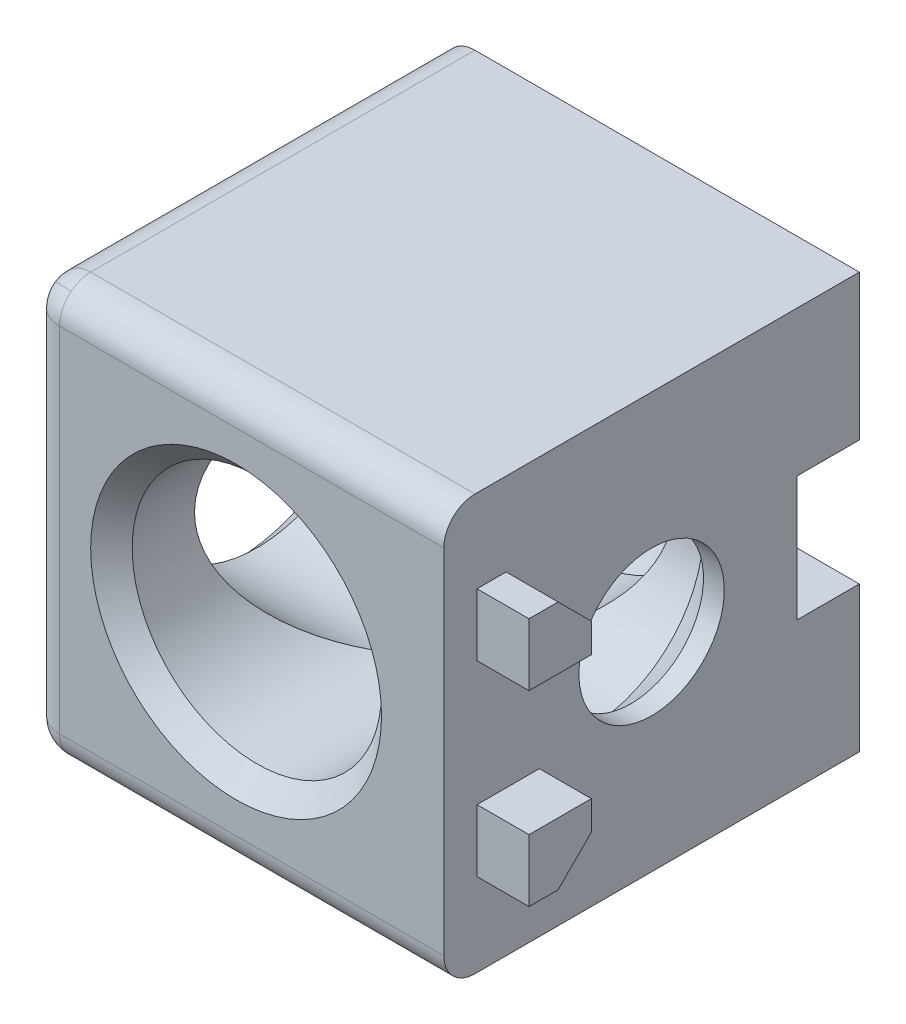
ISO-10303-21;
HEADER;
FILE_DESCRIPTION(('STEP AP214'),'2;1');
FILE_NAME('part.step','',(''),(''),'','','');
FILE_SCHEMA(('AUTOMOTIVE_DESIGN { 1 0 10303 214 1 1 1 1 }'));
ENDSEC;
DATA;
#1=APPLICATION_CONTEXT('core data for automotive mechanical design processes');
#2=APPLICATION_PROTOCOL_DEFINITION('international standard','automotive_design',2000,#1);
#3=PRODUCT_CONTEXT('',#1,'mechanical');
#4=PRODUCT('Part','Part','',(#3));
#5=PRODUCT_RELATED_PRODUCT_CATEGORY('part','',(#4));
#6=PRODUCT_DEFINITION_FORMATION('','',#4);
#7=PRODUCT_DEFINITION_CONTEXT('part definition',#1,'design');
#8=PRODUCT_DEFINITION('design','',#6,#7);
#9=PRODUCT_DEFINITION_SHAPE('','',#8);
#10=(LENGTH_UNIT() NAMED_UNIT(*) SI_UNIT(.MILLI.,.METRE.));
#11=(NAMED_UNIT(*) PLANE_ANGLE_UNIT() SI_UNIT($,.RADIAN.));
#12=(NAMED_UNIT(*) SI_UNIT($,.STERADIAN.) SOLID_ANGLE_UNIT());
#13=UNCERTAINTY_MEASURE_WITH_UNIT(LENGTH_MEASURE(1.E-05),#10,'distance_accuracy_value','');
#14=(GEOMETRIC_REPRESENTATION_CONTEXT(3) GLOBAL_UNCERTAINTY_ASSIGNED_CONTEXT((#13)) GLOBAL_UNIT_ASSIGNED_CONTEXT((#10,
#11,#12)) REPRESENTATION_CONTEXT('',''));
#15=CARTESIAN_POINT('',(0.,0.,0.));
#16=DIRECTION('',(0.,0.,1.));
#17=DIRECTION('',(1.,0.,0.));
#18=AXIS2_PLACEMENT_3D('',#15,#16,#17);
#19=CARTESIAN_POINT('',(0.,0.,10.));
#20=DIRECTION('',(-1.,0.,0.));
#21=DIRECTION('',(0.,0.,1.));
#22=AXIS2_PLACEMENT_3D('',#19,#20,#21);
#23=PLANE('',#22);
#24=CARTESIAN_POINT('',(0.,0.,10.));
#25=DIRECTION('',(-1.,0.,0.));
#26=DIRECTION('',(0.,0.,1.));
#27=AXIS2_PLACEMENT_3D('',#24,#25,#26);
#28=CIRCLE('',#27,6.);
#29=CARTESIAN_POINT('',(0.,-5.5,7.60208423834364));
#30=VERTEX_POINT('',#29);
#31=CARTESIAN_POINT('',(0.,-6.,10.));
#32=VERTEX_POINT('',#31);
#33=EDGE_CURVE('E19',#30,#32,#28,.T.);
#34=ORIENTED_EDGE('',*,*,#33,.T.);
#35=DIRECTION('',(0.,1.,0.));
#36=VECTOR('',#35,1.);
#37=CARTESIAN_POINT('',(0.,0.,10.));
#38=LINE('',#37,#36);
#39=CARTESIAN_POINT('',(0.,-5.5,10.));
#40=VERTEX_POINT('',#39);
#41=EDGE_CURVE('E186',#40,#32,#38,.F.);
#42=ORIENTED_EDGE('',*,*,#41,.F.);
#43=DIRECTION('',(0.,0.,1.));
#44=VECTOR('',#43,1.);
#45=CARTESIAN_POINT('',(0.,-5.5,3.));
#46=LINE('',#45,#44);
#47=EDGE_CURVE('E169',#40,#30,#46,.F.);
#48=ORIENTED_EDGE('',*,*,#47,.T.);
#49=EDGE_LOOP('',(#34,#42,#48));
#50=FACE_BOUND('',#49,.T.);
#51=ADVANCED_FACE('F16',(#50),#23,.T.);
#52=CARTESIAN_POINT('',(0.,0.,10.));
#53=DIRECTION('',(-1.,0.,0.));
#54=DIRECTION('',(0.,0.,1.));
#55=AXIS2_PLACEMENT_3D('',#52,#53,#54);
#56=PLANE('',#55);
#57=DIRECTION('',(0.,0.,1.));
#58=VECTOR('',#57,1.);
#59=CARTESIAN_POINT('',(0.,5.5,3.));
#60=LINE('',#59,#58);
#61=CARTESIAN_POINT('',(0.,5.5,7.60208423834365));
#62=VERTEX_POINT('',#61);
#63=CARTESIAN_POINT('',(0.,5.5,10.));
#64=VERTEX_POINT('',#63);
#65=EDGE_CURVE('E172',#62,#64,#60,.T.);
#66=ORIENTED_EDGE('',*,*,#65,.T.);
#67=DIRECTION('',(0.,1.,0.));
#68=VECTOR('',#67,1.);
#69=CARTESIAN_POINT('',(0.,0.,10.));
#70=LINE('',#69,#68);
#71=CARTESIAN_POINT('',(0.,6.,10.));
#72=VERTEX_POINT('',#71);
#73=EDGE_CURVE('E189',#72,#64,#70,.F.);
#74=ORIENTED_EDGE('',*,*,#73,.F.);
#75=CARTESIAN_POINT('',(0.,0.,10.));
#76=DIRECTION('',(-1.,0.,0.));
#77=DIRECTION('',(0.,0.,1.));
#78=AXIS2_PLACEMENT_3D('',#75,#76,#77);
#79=CIRCLE('',#78,6.);
#80=EDGE_CURVE('E176',#72,#62,#79,.T.);
#81=ORIENTED_EDGE('',*,*,#80,.T.);
#82=EDGE_LOOP('',(#66,#74,#81));
#83=FACE_BOUND('',#82,.T.);
#84=ADVANCED_FACE('F1089',(#83),#56,.T.);
#85=CARTESIAN_POINT('',(0.,0.,10.));
#86=DIRECTION('',(0.,0.,1.));
#87=DIRECTION('',(1.,0.,0.));
#88=AXIS2_PLACEMENT_3D('',#85,#86,#87);
#89=PLANE('',#88);
#90=DIRECTION('',(-1.,0.,0.));
#91=VECTOR('',#90,1.);
#92=CARTESIAN_POINT('',(7.,-5.5,10.));
#93=LINE('',#92,#91);
#94=CARTESIAN_POINT('',(2.39791576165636,-5.5,10.));
#95=VERTEX_POINT('',#94);
#96=EDGE_CURVE('E323',#95,#40,#93,.T.);
#97=ORIENTED_EDGE('',*,*,#96,.T.);
#98=ORIENTED_EDGE('',*,*,#41,.T.);
#99=CARTESIAN_POINT('',(0.,0.,10.));
#100=DIRECTION('',(0.,0.,1.));
#101=DIRECTION('',(1.,0.,0.));
#102=AXIS2_PLACEMENT_3D('',#99,#100,#101);
#103=CIRCLE('',#102,6.);
#104=EDGE_CURVE('E281',#32,#95,#103,.T.);
#105=ORIENTED_EDGE('',*,*,#104,.T.);
#106=EDGE_LOOP('',(#97,#98,#105));
#107=FACE_BOUND('',#106,.T.);
#108=ADVANCED_FACE('F1079',(#107),#89,.T.);
#109=CARTESIAN_POINT('',(0.,0.,10.));
#110=DIRECTION('',(0.,0.,1.));
#111=DIRECTION('',(1.,0.,0.));
#112=AXIS2_PLACEMENT_3D('',#109,#110,#111);
#113=PLANE('',#112);
#114=CARTESIAN_POINT('',(0.,0.,10.));
#115=DIRECTION('',(0.,0.,1.));
#116=DIRECTION('',(1.,0.,0.));
#117=AXIS2_PLACEMENT_3D('',#114,#115,#116);
#118=CIRCLE('',#117,6.);
#119=CARTESIAN_POINT('',(2.39791576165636,5.5,10.));
#120=VERTEX_POINT('',#119);
#121=EDGE_CURVE('E269',#120,#72,#118,.T.);
#122=ORIENTED_EDGE('',*,*,#121,.T.);
#123=ORIENTED_EDGE('',*,*,#73,.T.);
#124=DIRECTION('',(-1.,0.,0.));
#125=VECTOR('',#124,1.);
#126=CARTESIAN_POINT('',(7.,5.5,10.));
#127=LINE('',#126,#125);
#128=EDGE_CURVE('E175',#64,#120,#127,.F.);
#129=ORIENTED_EDGE('',*,*,#128,.T.);
#130=EDGE_LOOP('',(#122,#123,#129));
#131=FACE_BOUND('',#130,.T.);
#132=ADVANCED_FACE('F1070',(#131),#113,.T.);
#133=CARTESIAN_POINT('',(0.,0.,3.));
#134=DIRECTION('',(0.,0.,1.));
#135=DIRECTION('',(1.,0.,0.));
#136=AXIS2_PLACEMENT_3D('',#133,#134,#135);
#137=CYLINDRICAL_SURFACE('',#136,5.5);
#138=CARTESIAN_POINT('',(0.,0.,10.));
#139=DIRECTION('',(0.707106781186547,0.,0.707106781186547));
#140=DIRECTION('',(-0.707106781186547,0.,0.707106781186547));
#141=AXIS2_PLACEMENT_3D('',#138,#139,#140);
#142=ELLIPSE('',#141,7.77817459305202,5.5);
#143=EDGE_CURVE('E326',#40,#64,#142,.T.);
#144=ORIENTED_EDGE('',*,*,#143,.T.);
#145=ORIENTED_EDGE('',*,*,#65,.F.);
#146=CARTESIAN_POINT('',(0.,5.5,7.60208423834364));
#147=CARTESIAN_POINT('',(-0.0791581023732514,5.5000202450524,7.60217179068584));
#148=CARTESIAN_POINT('',(-0.158252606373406,5.49829207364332,7.59816631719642));
#149=CARTESIAN_POINT('',(-0.315328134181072,5.49150873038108,7.5826762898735));
#150=CARTESIAN_POINT('',(-0.393311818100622,5.48646372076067,7.57121458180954));
#151=CARTESIAN_POINT('',(-0.546178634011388,5.47334280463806,7.54179843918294));
#152=CARTESIAN_POINT('',(-0.621092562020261,5.46532740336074,7.52397386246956));
#153=CARTESIAN_POINT('',(-0.769056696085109,5.44647744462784,7.48277920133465));
#154=CARTESIAN_POINT('',(-0.842105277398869,5.43564051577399,7.45940445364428));
#155=CARTESIAN_POINT('',(-1.02374790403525,5.40502603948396,7.39470790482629));
#156=CARTESIAN_POINT('',(-1.13098224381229,5.38353495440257,7.35038855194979));
#157=CARTESIAN_POINT('',(-1.34075783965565,5.33516370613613,7.25428949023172));
#158=CARTESIAN_POINT('',(-1.44329636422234,5.30828045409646,7.20250551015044));
#159=CARTESIAN_POINT('',(-1.64523350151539,5.24922799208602,7.09319647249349));
#160=CARTESIAN_POINT('',(-1.74458417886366,5.21700303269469,7.03561368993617));
#161=CARTESIAN_POINT('',(-1.93943630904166,5.14774457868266,6.91690691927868));
#162=CARTESIAN_POINT('',(-2.03493627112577,5.11070924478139,6.85578158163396));
#163=CARTESIAN_POINT('',(-2.29820374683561,5.00020992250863,6.68103085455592));
#164=CARTESIAN_POINT('',(-2.46208503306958,4.92147062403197,6.56485243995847));
#165=CARTESIAN_POINT('',(-2.78013001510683,4.7490609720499,6.33016207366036));
#166=CARTESIAN_POINT('',(-2.93428697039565,4.65538041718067,6.21164857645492));
#167=CARTESIAN_POINT('',(-3.23272417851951,4.45329533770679,5.97605174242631));
#168=CARTESIAN_POINT('',(-3.37703700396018,4.34494330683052,5.85896485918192));
#169=CARTESIAN_POINT('',(-3.65592264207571,4.11303982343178,5.62854306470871));
#170=CARTESIAN_POINT('',(-3.79050062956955,3.98949654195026,5.5152061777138));
#171=CARTESIAN_POINT('',(-4.11344554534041,3.66138882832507,5.23973008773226));
#172=CARTESIAN_POINT('',(-4.29531200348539,3.44706879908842,5.08132465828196));
#173=CARTESIAN_POINT('',(-4.629601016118,2.98301113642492,4.78684074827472));
#174=CARTESIAN_POINT('',(-4.78205730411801,2.73331465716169,4.6507367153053));
#175=CARTESIAN_POINT('',(-5.02258131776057,2.25394244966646,4.43455797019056));
#176=CARTESIAN_POINT('',(-5.11743240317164,2.03034744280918,4.34871983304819));
#177=CARTESIAN_POINT('',(-5.2380309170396,1.68171973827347,4.23921092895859));
#178=CARTESIAN_POINT('',(-5.27460880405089,1.5633463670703,4.20592391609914));
#179=CARTESIAN_POINT('',(-5.34001681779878,1.32277956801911,4.14631762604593));
#180=CARTESIAN_POINT('',(-5.36884884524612,1.20058708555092,4.11999663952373));
#181=CARTESIAN_POINT('',(-5.42853939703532,0.901589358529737,4.06545413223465));
#182=CARTESIAN_POINT('',(-5.45524299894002,0.723229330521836,4.04100463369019));
#183=CARTESIAN_POINT('',(-5.49097178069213,0.363224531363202,4.0082791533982));
#184=CARTESIAN_POINT('',(-5.49999487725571,0.181579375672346,4.00000507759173));
#185=CARTESIAN_POINT('',(-5.50000357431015,-0.126694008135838,3.99999645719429));
#186=CARTESIAN_POINT('',(-5.49561691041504,-0.253355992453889,4.00401852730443));
#187=CARTESIAN_POINT('',(-5.47816809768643,-0.505618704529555,4.02000729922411));
#188=CARTESIAN_POINT('',(-5.46510387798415,-0.63121917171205,4.03197589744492));
#189=CARTESIAN_POINT('',(-5.4305447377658,-0.880349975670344,4.06360648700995));
#190=CARTESIAN_POINT('',(-5.40904398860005,-1.00387881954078,4.08327379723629));
#191=CARTESIAN_POINT('',(-5.35800926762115,-1.24791250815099,4.12989304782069));
#192=CARTESIAN_POINT('',(-5.32847161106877,-1.36841593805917,4.15684832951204));
#193=CARTESIAN_POINT('',(-5.26210833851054,-1.60473342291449,4.21730186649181));
#194=CARTESIAN_POINT('',(-5.22533576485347,-1.72057462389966,4.2507524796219));
#195=CARTESIAN_POINT('',(-5.14492903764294,-1.94788662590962,4.32373256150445));
#196=CARTESIAN_POINT('',(-5.10129235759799,-2.05935579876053,4.36326426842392));
#197=CARTESIAN_POINT('',(-4.96093517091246,-2.38649130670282,4.49007683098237));
#198=CARTESIAN_POINT('',(-4.85472650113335,-2.59502814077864,4.58561269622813));
#199=CARTESIAN_POINT('',(-4.6564965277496,-2.9313867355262,4.76248090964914));
#200=CARTESIAN_POINT('',(-4.56971412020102,-3.06471159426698,4.83953150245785));
#201=CARTESIAN_POINT('',(-4.38718842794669,-3.32073253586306,5.00044373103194));
#202=CARTESIAN_POINT('',(-4.29144448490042,-3.44342783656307,5.08430586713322));
#203=CARTESIAN_POINT('',(-4.09187641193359,-3.67836483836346,5.25753337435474));
#204=CARTESIAN_POINT('',(-3.98803646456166,-3.79058508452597,5.34690944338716));
#205=CARTESIAN_POINT('',(-3.77325416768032,-4.00443689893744,5.5296245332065));
#206=CARTESIAN_POINT('',(-3.66231270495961,-4.10606978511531,5.62296305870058));
#207=CARTESIAN_POINT('',(-3.43110641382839,-4.30127333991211,5.81452609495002));
#208=CARTESIAN_POINT('',(-3.31068160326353,-4.39459157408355,5.91281411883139));
#209=CARTESIAN_POINT('',(-3.06316837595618,-4.57056522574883,6.11059741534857));
#210=CARTESIAN_POINT('',(-2.93607845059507,-4.65321821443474,6.21009295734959));
#211=CARTESIAN_POINT('',(-2.67529772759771,-4.80788412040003,6.40833927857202));
#212=CARTESIAN_POINT('',(-2.54161447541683,-4.87990884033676,6.50709076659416));
#213=CARTESIAN_POINT('',(-2.26701502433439,-5.01337586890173,6.70152368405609));
#214=CARTESIAN_POINT('',(-2.12610264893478,-5.07482369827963,6.79720669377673));
#215=CARTESIAN_POINT('',(-1.82697811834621,-5.19032362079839,6.9877478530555));
#216=CARTESIAN_POINT('',(-1.66823499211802,-5.24369170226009,7.08219610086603));
#217=CARTESIAN_POINT('',(-1.33926879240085,-5.33718355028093,7.25696659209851));
#218=CARTESIAN_POINT('',(-1.16905906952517,-5.37732240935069,7.33730488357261));
#219=CARTESIAN_POINT('',(-0.86020643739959,-5.43397463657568,7.4553755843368));
#220=CARTESIAN_POINT('',(-0.724410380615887,-5.45389219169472,7.49874258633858));
#221=CARTESIAN_POINT('',(-0.44690233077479,-5.4835676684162,7.56445974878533));
#222=CARTESIAN_POINT('',(-0.305217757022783,-5.4933681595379,7.58689793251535));
#223=CARTESIAN_POINT('',(-0.135645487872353,-5.49839500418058,7.59840718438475));
#224=CARTESIAN_POINT('',(-0.108545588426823,-5.49899626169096,7.59978382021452));
#225=CARTESIAN_POINT('',(-0.0542996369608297,-5.4997982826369,7.60162069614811));
#226=CARTESIAN_POINT('',(-0.0271535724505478,-5.49999891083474,7.60208062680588));
#227=CARTESIAN_POINT('',(0.,-5.5,7.60208423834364));
#228=B_SPLINE_CURVE_WITH_KNOTS('',3,(#146,#147,#148,#149,#150,#151,#152,#153,#154,#155,#156,
#157,#158,#159,#160,#161,#162,#163,#164,#165,#166,#167,#168,#169,#170,#171,#172,#173,#174,#175,
#176,#177,#178,#179,#180,#181,#182,#183,#184,#185,#186,#187,#188,#189,#190,#191,#192,#193,#194,
#195,#196,#197,#198,#199,#200,#201,#202,#203,#204,#205,#206,#207,#208,#209,#210,#211,#212,#213,
#214,#215,#216,#217,#218,#219,#220,#221,#222,#223,#224,#225,#226,#227),.UNSPECIFIED.,.F.,.F.,(4,
2,2,2,2,2,2,2,2,2,2,2,2,2,2,2,2,2,2,2,2,2,2,2,2,2,2,2,2,2,2,2,2,2,2,2,2,2,2,2,4),(0.,
0.237252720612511,0.473781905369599,0.705736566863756,0.937886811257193,1.29127572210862,
1.64486764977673,2.00241368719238,2.36009683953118,3.00648221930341,3.65331083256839,
4.29788344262,4.94211085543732,5.90645161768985,6.86967961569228,7.63909628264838,
8.02354797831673,8.40790524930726,8.95230190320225,9.49676269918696,9.87665122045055,
10.2566304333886,10.6368726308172,11.0172894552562,11.3950147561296,11.7728794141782,
12.5281547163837,13.0578209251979,13.5875260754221,14.1182933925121,14.6489945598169,
15.1924489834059,15.7360269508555,16.2789966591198,16.8216820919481,17.3976250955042,
17.9729087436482,18.4032984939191,18.8318698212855,18.9132834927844,18.9947246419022),.UNSPECIFIED.);
#229=EDGE_CURVE('E164',#62,#30,#228,.T.);
#230=ORIENTED_EDGE('',*,*,#229,.T.);
#231=ORIENTED_EDGE('',*,*,#47,.F.);
#232=EDGE_LOOP('',(#144,#145,#230,#231));
#233=FACE_BOUND('',#232,.T.);
#234=CARTESIAN_POINT('',(0.,0.,2.99999999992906));
#235=DIRECTION('',(0.,0.,1.));
#236=DIRECTION('',(1.,0.,0.));
#237=AXIS2_PLACEMENT_3D('',#234,#235,#236);
#238=CIRCLE('',#237,5.49999999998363);
#239=CARTESIAN_POINT('',(5.49999999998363,0.,2.99999999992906));
#240=VERTEX_POINT('',#239);
#241=EDGE_CURVE('E192',#240,#240,#238,.F.);
#242=ORIENTED_EDGE('',*,*,#241,.T.);
#243=EDGE_LOOP('',(#242));
#244=FACE_BOUND('',#243,.T.);
#245=ADVANCED_FACE('F166',(#233,#244),#137,.F.);
#246=CARTESIAN_POINT('',(0.,0.,10.));
#247=DIRECTION('',(-1.,0.,0.));
#248=DIRECTION('',(0.,0.,1.));
#249=AXIS2_PLACEMENT_3D('',#246,#247,#248);
#250=CYLINDRICAL_SURFACE('',#249,6.);
#251=CARTESIAN_POINT('',(0.,0.,10.));
#252=DIRECTION('',(-0.707106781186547,0.,-0.707106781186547));
#253=DIRECTION('',(-0.707106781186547,0.,0.707106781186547));
#254=AXIS2_PLACEMENT_3D('',#251,#252,#253);
#255=ELLIPSE('',#254,8.48528137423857,6.);
#256=EDGE_CURVE('E183',#72,#32,#255,.F.);
#257=ORIENTED_EDGE('',*,*,#256,.T.);
#258=ORIENTED_EDGE('',*,*,#33,.F.);
#259=ORIENTED_EDGE('',*,*,#229,.F.);
#260=ORIENTED_EDGE('',*,*,#80,.F.);
#261=EDGE_LOOP('',(#257,#258,#259,#260));
#262=FACE_BOUND('',#261,.T.);
#263=CARTESIAN_POINT('',(-9.00000000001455,0.,10.));
#264=DIRECTION('',(-1.,0.,0.));
#265=DIRECTION('',(0.,0.,1.));
#266=AXIS2_PLACEMENT_3D('',#263,#264,#265);
#267=CIRCLE('',#266,5.99999999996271);
#268=CARTESIAN_POINT('',(-9.00000000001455,0.,15.9999999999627));
#269=VERTEX_POINT('',#268);
#270=EDGE_CURVE('E327',#269,#269,#267,.T.);
#271=ORIENTED_EDGE('',*,*,#270,.T.);
#272=EDGE_LOOP('',(#271));
#273=FACE_BOUND('',#272,.T.);
#274=ADVANCED_FACE('F180',(#262,#273),#250,.F.);
#275=CARTESIAN_POINT('',(7.,0.,10.));
#276=DIRECTION('',(-1.,0.,0.));
#277=DIRECTION('',(0.,0.,1.));
#278=AXIS2_PLACEMENT_3D('',#275,#276,#277);
#279=CYLINDRICAL_SURFACE('',#278,5.5);
#280=ORIENTED_EDGE('',*,*,#96,.F.);
#281=CARTESIAN_POINT('',(2.39791576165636,-5.5,10.));
#282=CARTESIAN_POINT('',(2.39782820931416,-5.5000202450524,10.0791581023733));
#283=CARTESIAN_POINT('',(2.40183368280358,-5.49829207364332,10.1582526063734));
#284=CARTESIAN_POINT('',(2.4173237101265,-5.49150873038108,10.3153281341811));
#285=CARTESIAN_POINT('',(2.42878541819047,-5.48646372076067,10.3933118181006));
#286=CARTESIAN_POINT('',(2.45820156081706,-5.47334280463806,10.5461786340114));
#287=CARTESIAN_POINT('',(2.47602613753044,-5.46532740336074,10.6210925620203));
#288=CARTESIAN_POINT('',(2.51722079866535,-5.44647744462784,10.7690566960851));
#289=CARTESIAN_POINT('',(2.54059554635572,-5.43564051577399,10.8421052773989));
#290=CARTESIAN_POINT('',(2.60529209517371,-5.40502603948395,11.0237479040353));
#291=CARTESIAN_POINT('',(2.64961144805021,-5.38353495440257,11.1309822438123));
#292=CARTESIAN_POINT('',(2.74571050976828,-5.33516370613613,11.3407578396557));
#293=CARTESIAN_POINT('',(2.79749448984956,-5.30828045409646,11.4432963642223));
#294=CARTESIAN_POINT('',(2.90680352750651,-5.24922799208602,11.6452335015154));
#295=CARTESIAN_POINT('',(2.96438631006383,-5.21700303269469,11.7445841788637));
#296=CARTESIAN_POINT('',(3.08309308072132,-5.14774457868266,11.9394363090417));
#297=CARTESIAN_POINT('',(3.14421841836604,-5.11070924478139,12.0349362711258));
#298=CARTESIAN_POINT('',(3.31896914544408,-5.00020992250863,12.2982037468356));
#299=CARTESIAN_POINT('',(3.43514756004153,-4.92147062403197,12.4620850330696));
#300=CARTESIAN_POINT('',(3.66983792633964,-4.7490609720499,12.7801300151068));
#301=CARTESIAN_POINT('',(3.78835142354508,-4.65538041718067,12.9342869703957));
#302=CARTESIAN_POINT('',(4.02394825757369,-4.4532953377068,13.2327241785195));
#303=CARTESIAN_POINT('',(4.14103514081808,-4.34494330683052,13.3770370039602));
#304=CARTESIAN_POINT('',(4.37145693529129,-4.11303982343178,13.6559226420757));
#305=CARTESIAN_POINT('',(4.4847938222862,-3.98949654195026,13.7905006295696));
#306=CARTESIAN_POINT('',(4.76026991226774,-3.66138882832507,14.1134455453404));
#307=CARTESIAN_POINT('',(4.91867534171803,-3.44706879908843,14.2953120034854));
#308=CARTESIAN_POINT('',(5.21315925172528,-2.98301113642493,14.629601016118));
#309=CARTESIAN_POINT('',(5.3492632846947,-2.73331465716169,14.782057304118));
#310=CARTESIAN_POINT('',(5.56544202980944,-2.25394244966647,15.0225813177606));
#311=CARTESIAN_POINT('',(5.65128016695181,-2.03034744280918,15.1174324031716));
#312=CARTESIAN_POINT('',(5.76078907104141,-1.68171973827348,15.2380309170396));
#313=CARTESIAN_POINT('',(5.79407608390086,-1.5633463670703,15.2746088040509));
#314=CARTESIAN_POINT('',(5.85368237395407,-1.32277956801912,15.3400168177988));
#315=CARTESIAN_POINT('',(5.88000336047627,-1.20058708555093,15.3688488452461));
#316=CARTESIAN_POINT('',(5.93454586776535,-0.90158935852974,15.4285393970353));
#317=CARTESIAN_POINT('',(5.95899536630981,-0.723229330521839,15.45524299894));
#318=CARTESIAN_POINT('',(5.9917208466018,-0.363224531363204,15.4909717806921));
#319=CARTESIAN_POINT('',(5.99999492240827,-0.181579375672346,15.4999948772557));
#320=CARTESIAN_POINT('',(6.00000354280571,0.126694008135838,15.5000035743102));
#321=CARTESIAN_POINT('',(5.99598147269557,0.253355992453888,15.495616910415));
#322=CARTESIAN_POINT('',(5.97999270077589,0.505618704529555,15.4781680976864));
#323=CARTESIAN_POINT('',(5.96802410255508,0.63121917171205,15.4651038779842));
#324=CARTESIAN_POINT('',(5.93639351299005,0.880349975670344,15.4305447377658));
#325=CARTESIAN_POINT('',(5.91672620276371,1.00387881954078,15.4090439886));
#326=CARTESIAN_POINT('',(5.87010695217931,1.24791250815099,15.3580092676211));
#327=CARTESIAN_POINT('',(5.84315167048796,1.36841593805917,15.3284716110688));
#328=CARTESIAN_POINT('',(5.78269813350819,1.60473342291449,15.2621083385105));
#329=CARTESIAN_POINT('',(5.7492475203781,1.72057462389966,15.2253357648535));
#330=CARTESIAN_POINT('',(5.67626743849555,1.94788662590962,15.1449290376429));
#331=CARTESIAN_POINT('',(5.63673573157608,2.05935579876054,15.101292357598));
#332=CARTESIAN_POINT('',(5.50992316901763,2.38649130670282,14.9609351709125));
#333=CARTESIAN_POINT('',(5.41438730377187,2.59502814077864,14.8547265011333));
#334=CARTESIAN_POINT('',(5.23751909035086,2.9313867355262,14.6564965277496));
#335=CARTESIAN_POINT('',(5.16046849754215,3.06471159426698,14.569714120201));
#336=CARTESIAN_POINT('',(4.99955626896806,3.32073253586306,14.3871884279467));
#337=CARTESIAN_POINT('',(4.91569413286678,3.44342783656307,14.2914444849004));
#338=CARTESIAN_POINT('',(4.74246662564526,3.67836483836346,14.0918764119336));
#339=CARTESIAN_POINT('',(4.65309055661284,3.79058508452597,13.9880364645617));
#340=CARTESIAN_POINT('',(4.4703754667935,4.00443689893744,13.7732541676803));
#341=CARTESIAN_POINT('',(4.37703694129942,4.1060697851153,13.6623127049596));
#342=CARTESIAN_POINT('',(4.18547390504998,4.30127333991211,13.4311064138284));
#343=CARTESIAN_POINT('',(4.08718588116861,4.39459157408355,13.3106816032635));
#344=CARTESIAN_POINT('',(3.88940258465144,4.57056522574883,13.0631683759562));
#345=CARTESIAN_POINT('',(3.78990704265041,4.65321821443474,12.9360784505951));
#346=CARTESIAN_POINT('',(3.59166072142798,4.80788412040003,12.6752977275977));
#347=CARTESIAN_POINT('',(3.49290923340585,4.87990884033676,12.5416144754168));
#348=CARTESIAN_POINT('',(3.29847631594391,5.01337586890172,12.2670150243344));
#349=CARTESIAN_POINT('',(3.20279330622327,5.07482369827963,12.1261026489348));
#350=CARTESIAN_POINT('',(3.0122521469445,5.19032362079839,11.8269781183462));
#351=CARTESIAN_POINT('',(2.91780389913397,5.24369170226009,11.668234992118));
#352=CARTESIAN_POINT('',(2.74303340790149,5.33718355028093,11.3392687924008));
#353=CARTESIAN_POINT('',(2.66269511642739,5.37732240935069,11.1690590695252));
#354=CARTESIAN_POINT('',(2.5446244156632,5.43397463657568,10.8602064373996));
#355=CARTESIAN_POINT('',(2.50125741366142,5.45389219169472,10.7244103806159));
#356=CARTESIAN_POINT('',(2.43554025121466,5.4835676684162,10.4469023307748));
#357=CARTESIAN_POINT('',(2.41310206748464,5.4933681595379,10.3052177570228));
#358=CARTESIAN_POINT('',(2.40159281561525,5.49839500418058,10.1356454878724));
#359=CARTESIAN_POINT('',(2.40021617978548,5.49899626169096,10.1085455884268));
#360=CARTESIAN_POINT('',(2.39837930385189,5.4997982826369,10.0542996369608));
#361=CARTESIAN_POINT('',(2.39791937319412,5.49999891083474,10.0271535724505));
#362=CARTESIAN_POINT('',(2.39791576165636,5.5,10.));
#363=B_SPLINE_CURVE_WITH_KNOTS('',3,(#281,#282,#283,#284,#285,#286,#287,#288,#289,#290,#291,
#292,#293,#294,#295,#296,#297,#298,#299,#300,#301,#302,#303,#304,#305,#306,#307,#308,#309,#310,
#311,#312,#313,#314,#315,#316,#317,#318,#319,#320,#321,#322,#323,#324,#325,#326,#327,#328,#329,
#330,#331,#332,#333,#334,#335,#336,#337,#338,#339,#340,#341,#342,#343,#344,#345,#346,#347,#348,
#349,#350,#351,#352,#353,#354,#355,#356,#357,#358,#359,#360,#361,#362),.UNSPECIFIED.,.F.,.F.,(4,
2,2,2,2,2,2,2,2,2,2,2,2,2,2,2,2,2,2,2,2,2,2,2,2,2,2,2,2,2,2,2,2,2,2,2,2,2,2,2,4),(0.,
0.23725272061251,0.473781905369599,0.705736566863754,0.937886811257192,1.29127572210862,
1.64486764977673,2.00241368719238,2.36009683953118,3.0064822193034,3.65331083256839,
4.29788344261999,4.94211085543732,5.90645161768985,6.86967961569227,7.63909628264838,
8.02354797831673,8.40790524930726,8.95230190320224,9.49676269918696,9.87665122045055,
10.2566304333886,10.6368726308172,11.0172894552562,11.3950147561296,11.7728794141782,
12.5281547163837,13.0578209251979,13.5875260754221,14.1182933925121,14.6489945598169,
15.1924489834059,15.7360269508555,16.2789966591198,16.8216820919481,17.3976250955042,
17.9729087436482,18.4032984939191,18.8318698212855,18.9132834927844,18.9947246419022),.UNSPECIFIED.);
#364=EDGE_CURVE('E272',#95,#120,#363,.T.);
#365=ORIENTED_EDGE('',*,*,#364,.T.);
#366=ORIENTED_EDGE('',*,*,#128,.F.);
#367=ORIENTED_EDGE('',*,*,#143,.F.);
#368=EDGE_LOOP('',(#280,#365,#366,#367));
#369=FACE_BOUND('',#368,.T.);
#370=CARTESIAN_POINT('',(7.000000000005,0.,10.));
#371=DIRECTION('',(-1.,0.,0.));
#372=DIRECTION('',(0.,0.,1.));
#373=AXIS2_PLACEMENT_3D('',#370,#371,#372);
#374=CIRCLE('',#373,5.50000000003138);
#375=CARTESIAN_POINT('',(7.000000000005,0.,15.5000000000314));
#376=VERTEX_POINT('',#375);
#377=EDGE_CURVE('E319',#376,#376,#374,.F.);
#378=ORIENTED_EDGE('',*,*,#377,.T.);
#379=EDGE_LOOP('',(#378));
#380=FACE_BOUND('',#379,.T.);
#381=ADVANCED_FACE('F283',(#369,#380),#279,.F.);
#382=CARTESIAN_POINT('',(0.,0.,10.));
#383=DIRECTION('',(0.,0.,1.));
#384=DIRECTION('',(1.,0.,0.));
#385=AXIS2_PLACEMENT_3D('',#382,#383,#384);
#386=CYLINDRICAL_SURFACE('',#385,6.);
#387=ORIENTED_EDGE('',*,*,#364,.F.);
#388=ORIENTED_EDGE('',*,*,#104,.F.);
#389=ORIENTED_EDGE('',*,*,#256,.F.);
#390=ORIENTED_EDGE('',*,*,#121,.F.);
#391=EDGE_LOOP('',(#387,#388,#389,#390));
#392=FACE_BOUND('',#391,.T.);
#393=CARTESIAN_POINT('',(0.,0.,18.9999999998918));
#394=DIRECTION('',(0.,0.,1.));
#395=DIRECTION('',(1.,0.,0.));
#396=AXIS2_PLACEMENT_3D('',#393,#394,#395);
#397=CIRCLE('',#396,5.99999999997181);
#398=CARTESIAN_POINT('',(5.99999999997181,0.,18.9999999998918));
#399=VERTEX_POINT('',#398);
#400=EDGE_CURVE('E259',#399,#399,#397,.T.);
#401=ORIENTED_EDGE('',*,*,#400,.T.);
#402=EDGE_LOOP('',(#401));
#403=FACE_BOUND('',#402,.T.);
#404=ADVANCED_FACE('F286',(#392,#403),#386,.F.);
#405=CARTESIAN_POINT('',(-8.48279603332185,9.66874430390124,19.4400748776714));
#406=CARTESIAN_POINT('',(-8.4943258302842,9.52650442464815,19.6171250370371));
#407=CARTESIAN_POINT('',(-8.3662453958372,9.37689162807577,19.7308056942));
#408=CARTESIAN_POINT('',(-8.15691099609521,9.28807279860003,19.7293214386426));
#409=CARTESIAN_POINT('',(-9.37499894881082,9.70511114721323,19.4111898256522));
#410=CARTESIAN_POINT('',(-9.40808528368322,9.29693429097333,19.9192595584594));
#411=CARTESIAN_POINT('',(-9.04054089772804,8.86759983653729,20.2454818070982));
#412=CARTESIAN_POINT('',(-8.43982710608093,8.61272201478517,20.241222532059));
#413=CARTESIAN_POINT('',(-10.0060657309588,9.23320346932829,18.9909690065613));
#414=CARTESIAN_POINT('',(-10.0493161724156,8.69963487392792,19.6551175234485));
#415=CARTESIAN_POINT('',(-9.56886232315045,8.13840907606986,20.0815550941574));
#416=CARTESIAN_POINT('',(-8.78360953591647,7.80523290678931,20.07598737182));
#417=CARTESIAN_POINT('',(-9.99800956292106,8.53706367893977,18.4322236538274));
#418=CARTESIAN_POINT('',(-10.0339578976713,8.09357913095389,18.9842419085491));
#419=CARTESIAN_POINT('',(-9.63462056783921,7.62710683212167,19.3386826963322));
#420=CARTESIAN_POINT('',(-8.98194445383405,7.35018183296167,19.3340549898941));
#421=(BOUNDED_SURFACE() B_SPLINE_SURFACE(3,3,((#405,#406,#407,#408),(#409,#410,#411,#412),(#413,
#414,#415,#416),(#417,#418,#419,#420)),.UNSPECIFIED.,.F.,.F.,
.F.) B_SPLINE_SURFACE_WITH_KNOTS((4,4),(4,4),(0.00327450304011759,1.),(0.,1.),
.UNSPECIFIED.) GEOMETRIC_REPRESENTATION_ITEM() RATIONAL_B_SPLINE_SURFACE(((0.99802956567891,
0.846454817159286,0.846454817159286,0.99802956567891),(0.798759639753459,0.67744881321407,
0.67744881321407,0.798759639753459),(0.799416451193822,0.678005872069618,0.678005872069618,
0.799416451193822),(1.,0.848125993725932,0.848125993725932,1.))) REPRESENTATION_ITEM('') SURFACE());
#422=CARTESIAN_POINT('',(-8.5,8.5,18.5));
#423=DIRECTION('',(0.,0.,-1.));
#424=DIRECTION('',(-1.,0.,0.));
#425=AXIS2_PLACEMENT_3D('',#422,#423,#424);
#426=CIRCLE('',#425,1.5);
#427=CARTESIAN_POINT('',(-9.99509625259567,8.62119074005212,18.5));
#428=VERTEX_POINT('',#427);
#429=CARTESIAN_POINT('',(-10.,8.5,18.5));
#430=VERTEX_POINT('',#429);
#431=EDGE_CURVE('E260',#428,#430,#426,.F.);
#432=CARTESIAN_POINT('',(-8.5,8.5,18.5));
#433=DIRECTION('',(0.,1.,0.));
#434=DIRECTION('',(0.,0.,1.));
#435=AXIS2_PLACEMENT_3D('',#432,#433,#434);
#436=CIRCLE('',#435,1.5);
#437=CARTESIAN_POINT('',(-8.5,8.5,20.));
#438=VERTEX_POINT('',#437);
#439=EDGE_CURVE('E253',#438,#430,#436,.F.);
#440=CARTESIAN_POINT('',(-8.5,8.5,18.5));
#441=DIRECTION('',(1.,0.,0.));
#442=DIRECTION('',(0.,0.,-1.));
#443=AXIS2_PLACEMENT_3D('',#440,#441,#442);
#444=CIRCLE('',#443,1.5);
#445=CARTESIAN_POINT('',(-8.5,9.66936843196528,19.4394559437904));
#446=VERTEX_POINT('',#445);
#447=EDGE_CURVE('E262',#438,#446,#444,.F.);
#448=CARTESIAN_POINT('',(-9.99588866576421,8.61065524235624,18.4914843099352));
#449=CARTESIAN_POINT('',(-9.9503736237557,9.2667399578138,19.0215385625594));
#450=CARTESIAN_POINT('',(-9.33658702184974,9.69927181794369,19.4090000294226));
#451=CARTESIAN_POINT('',(-8.49245600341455,9.66911373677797,19.439742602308));
#452=(BOUNDED_CURVE() B_SPLINE_CURVE(3,(#448,#449,#450,#451),.UNSPECIFIED.,.F.,
.F.) B_SPLINE_CURVE_WITH_KNOTS((4,4),(0.00289965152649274,1.),
.UNSPECIFIED.) CURVE() GEOMETRIC_REPRESENTATION_ITEM() RATIONAL_B_SPLINE_CURVE((1.,
0.815744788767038,0.815210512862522,0.998397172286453)) REPRESENTATION_ITEM(''));
#453=EDGE_CURVE('E343',#428,#446,#452,.T.);
#454=ORIENTED_EDGE('',*,*,#431,.T.);
#455=ORIENTED_EDGE('',*,*,#439,.F.);
#456=ORIENTED_EDGE('',*,*,#447,.T.);
#457=ORIENTED_EDGE('',*,*,#453,.F.);
#458=EDGE_LOOP('',(#454,#455,#456,#457));
#459=FACE_BOUND('',#458,.T.);
#460=ADVANCED_FACE('F290',(#459),#421,.T.);
#461=CARTESIAN_POINT('',(0.,0.,2.99999999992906));
#462=DIRECTION('',(0.,0.,1.));
#463=DIRECTION('',(1.,0.,0.));
#464=AXIS2_PLACEMENT_3D('',#461,#462,#463);
#465=CONICAL_SURFACE('',#464,5.49999999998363,0.785398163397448);
#466=ORIENTED_EDGE('',*,*,#241,.F.);
#467=EDGE_LOOP('',(#466));
#468=FACE_BOUND('',#467,.T.);
#469=CARTESIAN_POINT('',(0.,0.,1.));
#470=DIRECTION('',(0.,0.,1.));
#471=DIRECTION('',(1.,0.,0.));
#472=AXIS2_PLACEMENT_3D('',#469,#470,#471);
#473=CIRCLE('',#472,3.5);
#474=CARTESIAN_POINT('',(3.5,0.,1.));
#475=VERTEX_POINT('',#474);
#476=EDGE_CURVE('E341',#475,#475,#473,.F.);
#477=ORIENTED_EDGE('',*,*,#476,.T.);
#478=EDGE_LOOP('',(#477));
#479=FACE_BOUND('',#478,.T.);
#480=ADVANCED_FACE('F297',(#468,#479),#465,.F.);
#481=CARTESIAN_POINT('',(-9.99999999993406,0.,10.));
#482=DIRECTION('',(-1.,0.,0.));
#483=DIRECTION('',(0.,0.,1.));
#484=AXIS2_PLACEMENT_3D('',#481,#482,#483);
#485=CONICAL_SURFACE('',#484,6.99999999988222,0.785398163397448);
#486=ORIENTED_EDGE('',*,*,#270,.F.);
#487=EDGE_LOOP('',(#486));
#488=FACE_BOUND('',#487,.T.);
#489=CARTESIAN_POINT('',(-9.99999999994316,0.,10.));
#490=DIRECTION('',(-1.,0.,0.));
#491=DIRECTION('',(0.,0.,1.));
#492=AXIS2_PLACEMENT_3D('',#489,#490,#491);
#493=CIRCLE('',#492,6.99999999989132);
#494=CARTESIAN_POINT('',(-9.99999999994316,0.,16.9999999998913));
#495=VERTEX_POINT('',#494);
#496=EDGE_CURVE('E249',#495,#495,#493,.F.);
#497=ORIENTED_EDGE('',*,*,#496,.F.);
#498=EDGE_LOOP('',(#497));
#499=FACE_BOUND('',#498,.T.);
#500=ADVANCED_FACE('F338',(#488,#499),#485,.F.);
#501=CARTESIAN_POINT('',(-7.07500913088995,-4.32499086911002,-2.5));
#502=DIRECTION('',(0.,0.,1.));
#503=DIRECTION('',(1.,0.,0.));
#504=AXIS2_PLACEMENT_3D('',#501,#502,#503);
#505=PLANE('',#504);
#506=DIRECTION('',(0.,-1.,0.));
#507=VECTOR('',#506,1.);
#508=CARTESIAN_POINT('',(-8.39999999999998,-6.,-2.5));
#509=LINE('',#508,#507);
#510=CARTESIAN_POINT('',(-8.39999999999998,-3.,-2.5));
#511=VERTEX_POINT('',#510);
#512=CARTESIAN_POINT('',(-8.39999999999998,-6.,-2.5));
#513=VERTEX_POINT('',#512);
#514=EDGE_CURVE('E569',#511,#513,#509,.T.);
#515=ORIENTED_EDGE('',*,*,#514,.F.);
#516=DIRECTION('',(1.,0.,0.));
#517=VECTOR('',#516,1.);
#518=CARTESIAN_POINT('',(-8.39999999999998,-3.,-2.5));
#519=LINE('',#518,#517);
#520=CARTESIAN_POINT('',(-5.39999999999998,-3.,-2.5));
#521=VERTEX_POINT('',#520);
#522=EDGE_CURVE('E785',#521,#511,#519,.F.);
#523=ORIENTED_EDGE('',*,*,#522,.F.);
#524=DIRECTION('',(0.,1.,0.));
#525=VECTOR('',#524,1.);
#526=CARTESIAN_POINT('',(-5.39999999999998,-3.,-2.5));
#527=LINE('',#526,#525);
#528=CARTESIAN_POINT('',(-5.4,-4.40000000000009,-2.5));
#529=VERTEX_POINT('',#528);
#530=EDGE_CURVE('E329',#529,#521,#527,.T.);
#531=ORIENTED_EDGE('',*,*,#530,.F.);
#532=DIRECTION('',(0.70710678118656,0.707106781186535,0.));
#533=VECTOR('',#532,1.);
#534=CARTESIAN_POINT('',(-5.39999999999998,-4.40000000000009,-2.5));
#535=LINE('',#534,#533);
#536=CARTESIAN_POINT('',(-6.99999999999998,-6.00000000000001,-2.5));
#537=VERTEX_POINT('',#536);
#538=EDGE_CURVE('E648',#537,#529,#535,.T.);
#539=ORIENTED_EDGE('',*,*,#538,.F.);
#540=DIRECTION('',(1.,0.,0.));
#541=VECTOR('',#540,1.);
#542=CARTESIAN_POINT('',(-7.,-6.,-2.5));
#543=LINE('',#542,#541);
#544=EDGE_CURVE('E627',#513,#537,#543,.T.);
#545=ORIENTED_EDGE('',*,*,#544,.F.);
#546=EDGE_LOOP('',(#515,#523,#531,#539,#545));
#547=FACE_BOUND('',#546,.T.);
#548=ADVANCED_FACE('F442',(#547),#505,.F.);
#549=CARTESIAN_POINT('',(-5.39999999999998,-3.,-2.5));
#550=DIRECTION('',(1.,0.,0.));
#551=DIRECTION('',(0.,1.,0.));
#552=AXIS2_PLACEMENT_3D('',#549,#550,#551);
#553=PLANE('',#552);
#554=DIRECTION('',(0.,1.,0.));
#555=VECTOR('',#554,1.);
#556=CARTESIAN_POINT('',(-5.39999999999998,-3.,0.));
#557=LINE('',#556,#555);
#558=CARTESIAN_POINT('',(-5.39999999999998,-3.,0.));
#559=VERTEX_POINT('',#558);
#560=CARTESIAN_POINT('',(-5.40000000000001,-4.40000000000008,0.));
#561=VERTEX_POINT('',#560);
#562=EDGE_CURVE('E331',#559,#561,#557,.F.);
#563=ORIENTED_EDGE('',*,*,#562,.T.);
#564=DIRECTION('',(0.,0.,1.));
#565=VECTOR('',#564,1.);
#566=CARTESIAN_POINT('',(-5.39999999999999,-4.40000000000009,-2.5));
#567=LINE('',#566,#565);
#568=EDGE_CURVE('E634',#529,#561,#567,.T.);
#569=ORIENTED_EDGE('',*,*,#568,.F.);
#570=ORIENTED_EDGE('',*,*,#530,.T.);
#571=DIRECTION('',(0.,0.,1.));
#572=VECTOR('',#571,1.);
#573=CARTESIAN_POINT('',(-5.39999999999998,-3.,-2.5));
#574=LINE('',#573,#572);
#575=EDGE_CURVE('E637',#559,#521,#574,.F.);
#576=ORIENTED_EDGE('',*,*,#575,.F.);
#577=EDGE_LOOP('',(#563,#569,#570,#576));
#578=FACE_BOUND('',#577,.T.);
#579=ADVANCED_FACE('F438',(#578),#553,.T.);
#580=CARTESIAN_POINT('',(-7.,-6.,-2.5));
#581=DIRECTION('',(0.,-1.,0.));
#582=DIRECTION('',(1.,0.,0.));
#583=AXIS2_PLACEMENT_3D('',#580,#581,#582);
#584=PLANE('',#583);
#585=DIRECTION('',(1.,0.,0.));
#586=VECTOR('',#585,1.);
#587=CARTESIAN_POINT('',(-7.,-6.,0.));
#588=LINE('',#587,#586);
#589=CARTESIAN_POINT('',(-6.99999999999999,-6.00000000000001,0.));
#590=VERTEX_POINT('',#589);
#591=CARTESIAN_POINT('',(-8.39999999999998,-6.,0.));
#592=VERTEX_POINT('',#591);
#593=EDGE_CURVE('E624',#590,#592,#588,.F.);
#594=ORIENTED_EDGE('',*,*,#593,.T.);
#595=DIRECTION('',(0.,0.,1.));
#596=VECTOR('',#595,1.);
#597=CARTESIAN_POINT('',(-8.39999999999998,-6.,-2.5));
#598=LINE('',#597,#596);
#599=EDGE_CURVE('E571',#513,#592,#598,.T.);
#600=ORIENTED_EDGE('',*,*,#599,.F.);
#601=ORIENTED_EDGE('',*,*,#544,.T.);
#602=DIRECTION('',(0.,0.,1.));
#603=VECTOR('',#602,1.);
#604=CARTESIAN_POINT('',(-6.99999999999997,-6.00000000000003,-2.5));
#605=LINE('',#604,#603);
#606=EDGE_CURVE('E650',#590,#537,#605,.F.);
#607=ORIENTED_EDGE('',*,*,#606,.F.);
#608=EDGE_LOOP('',(#594,#600,#601,#607));
#609=FACE_BOUND('',#608,.T.);
#610=ADVANCED_FACE('F434',(#609),#584,.T.);
#611=CARTESIAN_POINT('',(-5.39999999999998,4.39999999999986,-2.5));
#612=DIRECTION('',(1.,0.,0.));
#613=DIRECTION('',(0.,1.,0.));
#614=AXIS2_PLACEMENT_3D('',#611,#612,#613);
#615=PLANE('',#614);
#616=DIRECTION('',(0.,1.,0.));
#617=VECTOR('',#616,1.);
#618=CARTESIAN_POINT('',(-5.39999999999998,4.39999999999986,0.));
#619=LINE('',#618,#617);
#620=CARTESIAN_POINT('',(-5.39999999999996,4.39999999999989,0.));
#621=VERTEX_POINT('',#620);
#622=CARTESIAN_POINT('',(-5.39999999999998,3.,0.));
#623=VERTEX_POINT('',#622);
#624=EDGE_CURVE('E621',#621,#623,#619,.F.);
#625=ORIENTED_EDGE('',*,*,#624,.T.);
#626=DIRECTION('',(0.,0.,1.));
#627=VECTOR('',#626,1.);
#628=CARTESIAN_POINT('',(-5.39999999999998,3.,-2.5));
#629=LINE('',#628,#627);
#630=CARTESIAN_POINT('',(-5.39999999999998,3.,-2.5));
#631=VERTEX_POINT('',#630);
#632=EDGE_CURVE('E765',#631,#623,#629,.T.);
#633=ORIENTED_EDGE('',*,*,#632,.F.);
#634=DIRECTION('',(0.,1.,0.));
#635=VECTOR('',#634,1.);
#636=CARTESIAN_POINT('',(-5.39999999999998,4.32499086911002,-2.5));
#637=LINE('',#636,#635);
#638=CARTESIAN_POINT('',(-5.39999999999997,4.3999999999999,-2.5));
#639=VERTEX_POINT('',#638);
#640=EDGE_CURVE('E619',#631,#639,#637,.T.);
#641=ORIENTED_EDGE('',*,*,#640,.T.);
#642=DIRECTION('',(0.,0.,1.));
#643=VECTOR('',#642,1.);
#644=CARTESIAN_POINT('',(-5.39999999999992,4.39999999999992,-2.5));
#645=LINE('',#644,#643);
#646=EDGE_CURVE('E771',#621,#639,#645,.F.);
#647=ORIENTED_EDGE('',*,*,#646,.F.);
#648=EDGE_LOOP('',(#625,#633,#641,#647));
#649=FACE_BOUND('',#648,.T.);
#650=ADVANCED_FACE('F430',(#649),#615,.T.);
#651=CARTESIAN_POINT('',(-7.07500913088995,4.32499086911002,-2.5));
#652=DIRECTION('',(0.,0.,1.));
#653=DIRECTION('',(1.,0.,0.));
#654=AXIS2_PLACEMENT_3D('',#651,#652,#653);
#655=PLANE('',#654);
#656=ORIENTED_EDGE('',*,*,#640,.F.);
#657=DIRECTION('',(1.,0.,0.));
#658=VECTOR('',#657,1.);
#659=CARTESIAN_POINT('',(-5.39999999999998,3.,-2.5));
#660=LINE('',#659,#658);
#661=CARTESIAN_POINT('',(-8.39999999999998,3.,-2.5));
#662=VERTEX_POINT('',#661);
#663=EDGE_CURVE('E768',#662,#631,#660,.T.);
#664=ORIENTED_EDGE('',*,*,#663,.F.);
#665=DIRECTION('',(0.,-1.,0.));
#666=VECTOR('',#665,1.);
#667=CARTESIAN_POINT('',(-8.39999999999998,3.,-2.5));
#668=LINE('',#667,#666);
#669=CARTESIAN_POINT('',(-8.4,6.,-2.5));
#670=VERTEX_POINT('',#669);
#671=EDGE_CURVE('E763',#670,#662,#668,.T.);
#672=ORIENTED_EDGE('',*,*,#671,.F.);
#673=DIRECTION('',(1.,0.,0.));
#674=VECTOR('',#673,1.);
#675=CARTESIAN_POINT('',(-8.39999999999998,6.,-2.5));
#676=LINE('',#675,#674);
#677=CARTESIAN_POINT('',(-7.,6.,-2.5));
#678=VERTEX_POINT('',#677);
#679=EDGE_CURVE('E617',#678,#670,#676,.F.);
#680=ORIENTED_EDGE('',*,*,#679,.F.);
#681=DIRECTION('',(-0.707106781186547,0.707106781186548,0.));
#682=VECTOR('',#681,1.);
#683=CARTESIAN_POINT('',(-7.,6.,-2.5));
#684=LINE('',#683,#682);
#685=EDGE_CURVE('E777',#639,#678,#684,.T.);
#686=ORIENTED_EDGE('',*,*,#685,.F.);
#687=EDGE_LOOP('',(#656,#664,#672,#680,#686));
#688=FACE_BOUND('',#687,.T.);
#689=ADVANCED_FACE('F426',(#688),#655,.F.);
#690=CARTESIAN_POINT('',(-8.39999999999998,6.,-2.5));
#691=DIRECTION('',(0.,1.,0.));
#692=DIRECTION('',(0.,0.,1.));
#693=AXIS2_PLACEMENT_3D('',#690,#691,#692);
#694=PLANE('',#693);
#695=DIRECTION('',(1.,0.,0.));
#696=VECTOR('',#695,1.);
#697=CARTESIAN_POINT('',(-8.39999999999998,6.,0.));
#698=LINE('',#697,#696);
#699=CARTESIAN_POINT('',(-8.4,6.,0.));
#700=VERTEX_POINT('',#699);
#701=CARTESIAN_POINT('',(-7.,6.,0.));
#702=VERTEX_POINT('',#701);
#703=EDGE_CURVE('E322',#700,#702,#698,.T.);
#704=ORIENTED_EDGE('',*,*,#703,.T.);
#705=DIRECTION('',(0.,0.,1.));
#706=VECTOR('',#705,1.);
#707=CARTESIAN_POINT('',(-7.,6.,-2.5));
#708=LINE('',#707,#706);
#709=EDGE_CURVE('E774',#678,#702,#708,.T.);
#710=ORIENTED_EDGE('',*,*,#709,.F.);
#711=ORIENTED_EDGE('',*,*,#679,.T.);
#712=DIRECTION('',(0.,0.,1.));
#713=VECTOR('',#712,1.);
#714=CARTESIAN_POINT('',(-8.40000000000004,6.,-2.5));
#715=LINE('',#714,#713);
#716=EDGE_CURVE('E614',#700,#670,#715,.F.);
#717=ORIENTED_EDGE('',*,*,#716,.F.);
#718=EDGE_LOOP('',(#704,#710,#711,#717));
#719=FACE_BOUND('',#718,.T.);
#720=ADVANCED_FACE('F422',(#719),#694,.T.);
#721=CARTESIAN_POINT('',(7.000000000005,0.,10.));
#722=DIRECTION('',(-1.,0.,0.));
#723=DIRECTION('',(0.,0.,1.));
#724=AXIS2_PLACEMENT_3D('',#721,#722,#723);
#725=CONICAL_SURFACE('',#724,5.50000000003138,0.785398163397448);
#726=ORIENTED_EDGE('',*,*,#377,.F.);
#727=EDGE_LOOP('',(#726));
#728=FACE_BOUND('',#727,.T.);
#729=CARTESIAN_POINT('',(9.,0.,10.));
#730=DIRECTION('',(-1.,0.,0.));
#731=DIRECTION('',(0.,0.,1.));
#732=AXIS2_PLACEMENT_3D('',#729,#730,#731);
#733=CIRCLE('',#732,3.5);
#734=CARTESIAN_POINT('',(9.,0.,13.5));
#735=VERTEX_POINT('',#734);
#736=EDGE_CURVE('E611',#735,#735,#733,.F.);
#737=ORIENTED_EDGE('',*,*,#736,.T.);
#738=EDGE_LOOP('',(#737));
#739=FACE_BOUND('',#738,.T.);
#740=ADVANCED_FACE('F413',(#728,#739),#725,.F.);
#741=CARTESIAN_POINT('',(-9.33406038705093,-7.53282662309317,19.2867140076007));
#742=CARTESIAN_POINT('',(-9.34400160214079,-8.12251351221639,20.0011259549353));
#743=CARTESIAN_POINT('',(-8.62041882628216,-8.64321414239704,20.2530198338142));
#744=CARTESIAN_POINT('',(-7.80135377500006,-8.63587607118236,19.8203905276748));
#745=CARTESIAN_POINT('',(-10.0759064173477,-7.9105613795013,18.9646028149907));
#746=CARTESIAN_POINT('',(-10.0904547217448,-8.7735287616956,20.0100969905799));
#747=CARTESIAN_POINT('',(-9.0315396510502,-9.53553936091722,20.3787268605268));
#748=CARTESIAN_POINT('',(-7.83289264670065,-9.52480058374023,19.7456027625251));
#749=CARTESIAN_POINT('',(-10.2407803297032,-8.58599320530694,18.4047964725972));
#750=CARTESIAN_POINT('',(-10.2543291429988,-9.38967338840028,19.3784635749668));
#751=CARTESIAN_POINT('',(-9.26816318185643,-10.0993326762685,19.7217680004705));
#752=CARTESIAN_POINT('',(-8.15186508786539,-10.0893316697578,19.132140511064));
#753=CARTESIAN_POINT('',(-9.72976718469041,-9.15390154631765,17.9431468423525));
#754=CARTESIAN_POINT('',(-9.73730956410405,-9.60129577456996,18.4851697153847));
#755=CARTESIAN_POINT('',(-9.188328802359,-9.99635027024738,18.6762810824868));
#756=CARTESIAN_POINT('',(-8.56690583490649,-9.99078289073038,18.3480461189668));
#757=(BOUNDED_SURFACE() B_SPLINE_SURFACE(3,3,((#741,#742,#743,#744),(#745,#746,#747,#748),(#749,
#750,#751,#752),(#753,#754,#755,#756)),.UNSPECIFIED.,.F.,.F.,
.F.) B_SPLINE_SURFACE_WITH_KNOTS((4,4),(4,4),(0.,1.),(0.000174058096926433,1.),
.UNSPECIFIED.) GEOMETRIC_REPRESENTATION_ITEM() RATIONAL_B_SPLINE_SURFACE(((0.999846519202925,
0.706022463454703,0.706073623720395,1.),(0.799896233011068,0.564831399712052,0.564872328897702,
0.80001902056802),(0.799896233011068,0.564831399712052,0.564872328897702,0.80001902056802),
(0.999846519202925,0.706022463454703,0.706073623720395,1.))) REPRESENTATION_ITEM('') SURFACE());
#758=CARTESIAN_POINT('',(-8.5,-8.5,18.5));
#759=DIRECTION('',(0.,0.,1.));
#760=DIRECTION('',(1.,0.,0.));
#761=AXIS2_PLACEMENT_3D('',#758,#759,#760);
#762=CIRCLE('',#761,1.5);
#763=CARTESIAN_POINT('',(-8.5,-10.,18.5));
#764=VERTEX_POINT('',#763);
#765=CARTESIAN_POINT('',(-10.,-8.5,18.5));
#766=VERTEX_POINT('',#765);
#767=EDGE_CURVE('E245',#764,#766,#762,.F.);
#768=CARTESIAN_POINT('',(-8.5,-8.5,18.5));
#769=DIRECTION('',(1.,0.,0.));
#770=DIRECTION('',(0.,0.,-1.));
#771=AXIS2_PLACEMENT_3D('',#768,#769,#770);
#772=CIRCLE('',#771,1.5);
#773=CARTESIAN_POINT('',(-8.5,-8.5,20.));
#774=VERTEX_POINT('',#773);
#775=EDGE_CURVE('E241',#774,#764,#772,.T.);
#776=CARTESIAN_POINT('',(-8.5,-8.5,18.5));
#777=DIRECTION('',(0.,1.,0.));
#778=DIRECTION('',(0.,0.,1.));
#779=AXIS2_PLACEMENT_3D('',#776,#777,#778);
#780=CIRCLE('',#779,1.5);
#781=EDGE_CURVE('E257',#766,#774,#780,.T.);
#782=ORIENTED_EDGE('',*,*,#767,.F.);
#783=ORIENTED_EDGE('',*,*,#775,.F.);
#784=ORIENTED_EDGE('',*,*,#781,.F.);
#785=EDGE_LOOP('',(#782,#783,#784));
#786=FACE_BOUND('',#785,.T.);
#787=ADVANCED_FACE('F407',(#786),#757,.T.);
#788=CARTESIAN_POINT('',(0.,0.,19.999999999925));
#789=DIRECTION('',(0.,0.,1.));
#790=DIRECTION('',(1.,0.,0.));
#791=AXIS2_PLACEMENT_3D('',#788,#789,#790);
#792=CONICAL_SURFACE('',#791,6.99999999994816,0.785398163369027);
#793=ORIENTED_EDGE('',*,*,#400,.F.);
#794=EDGE_LOOP('',(#793));
#795=FACE_BOUND('',#794,.T.);
#796=CARTESIAN_POINT('',(0.,0.,19.999999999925));
#797=DIRECTION('',(0.,0.,1.));
#798=DIRECTION('',(1.,0.,0.));
#799=AXIS2_PLACEMENT_3D('',#796,#797,#798);
#800=CIRCLE('',#799,6.99999999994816);
#801=CARTESIAN_POINT('',(6.99999999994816,0.,19.999999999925));
#802=VERTEX_POINT('',#801);
#803=EDGE_CURVE('E236',#802,#802,#800,.T.);
#804=ORIENTED_EDGE('',*,*,#803,.T.);
#805=EDGE_LOOP('',(#804));
#806=FACE_BOUND('',#805,.T.);
#807=ADVANCED_FACE('F403',(#795,#806),#792,.F.);
#808=CARTESIAN_POINT('',(-8.5,0.,18.5));
#809=DIRECTION('',(0.,1.,0.));
#810=DIRECTION('',(0.,0.,1.));
#811=AXIS2_PLACEMENT_3D('',#808,#809,#810);
#812=CYLINDRICAL_SURFACE('',#811,1.5);
#813=ORIENTED_EDGE('',*,*,#439,.T.);
#814=DIRECTION('',(0.,1.,0.));
#815=VECTOR('',#814,1.);
#816=CARTESIAN_POINT('',(-10.,0.,18.5));
#817=LINE('',#816,#815);
#818=EDGE_CURVE('E252',#766,#430,#817,.T.);
#819=ORIENTED_EDGE('',*,*,#818,.F.);
#820=ORIENTED_EDGE('',*,*,#781,.T.);
#821=DIRECTION('',(0.,1.,0.));
#822=VECTOR('',#821,1.);
#823=CARTESIAN_POINT('',(-8.5,0.,20.));
#824=LINE('',#823,#822);
#825=EDGE_CURVE('E584',#774,#438,#824,.T.);
#826=ORIENTED_EDGE('',*,*,#825,.T.);
#827=EDGE_LOOP('',(#813,#819,#820,#826));
#828=FACE_BOUND('',#827,.T.);
#829=ADVANCED_FACE('F399',(#828),#812,.T.);
#830=CARTESIAN_POINT('',(12.5,-4.39999999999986,15.3999999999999));
#831=DIRECTION('',(0.,0.,-1.));
#832=DIRECTION('',(0.,1.,0.));
#833=AXIS2_PLACEMENT_3D('',#830,#831,#832);
#834=PLANE('',#833);
#835=DIRECTION('',(0.,1.,0.));
#836=VECTOR('',#835,1.);
#837=CARTESIAN_POINT('',(10.,-4.39999999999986,15.3999999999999));
#838=LINE('',#837,#836);
#839=CARTESIAN_POINT('',(10.,-4.39999999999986,15.3999999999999));
#840=VERTEX_POINT('',#839);
#841=CARTESIAN_POINT('',(10.,-3.,15.3999999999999));
#842=VERTEX_POINT('',#841);
#843=EDGE_CURVE('E256',#840,#842,#838,.T.);
#844=ORIENTED_EDGE('',*,*,#843,.T.);
#845=DIRECTION('',(1.,0.,0.));
#846=VECTOR('',#845,1.);
#847=CARTESIAN_POINT('',(12.5,-3.,15.3999999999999));
#848=LINE('',#847,#846);
#849=CARTESIAN_POINT('',(12.5,-3.,15.3999999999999));
#850=VERTEX_POINT('',#849);
#851=EDGE_CURVE('E708',#850,#842,#848,.F.);
#852=ORIENTED_EDGE('',*,*,#851,.F.);
#853=DIRECTION('',(0.,-1.,0.));
#854=VECTOR('',#853,1.);
#855=CARTESIAN_POINT('',(12.5,-4.32499086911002,15.3999999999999));
#856=LINE('',#855,#854);
#857=CARTESIAN_POINT('',(12.5,-4.39999999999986,15.3999999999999));
#858=VERTEX_POINT('',#857);
#859=EDGE_CURVE('E606',#850,#858,#856,.T.);
#860=ORIENTED_EDGE('',*,*,#859,.T.);
#861=DIRECTION('',(1.,0.,0.));
#862=VECTOR('',#861,1.);
#863=CARTESIAN_POINT('',(12.5,-4.39999999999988,15.3999999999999));
#864=LINE('',#863,#862);
#865=EDGE_CURVE('E714',#840,#858,#864,.T.);
#866=ORIENTED_EDGE('',*,*,#865,.F.);
#867=EDGE_LOOP('',(#844,#852,#860,#866));
#868=FACE_BOUND('',#867,.T.);
#869=ADVANCED_FACE('F395',(#868),#834,.T.);
#870=CARTESIAN_POINT('',(12.5,-4.32499086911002,17.0750091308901));
#871=DIRECTION('',(-1.,0.,0.));
#872=DIRECTION('',(0.,-1.,0.));
#873=AXIS2_PLACEMENT_3D('',#870,#871,#872);
#874=PLANE('',#873);
#875=ORIENTED_EDGE('',*,*,#859,.F.);
#876=DIRECTION('',(0.,0.,1.));
#877=VECTOR('',#876,1.);
#878=CARTESIAN_POINT('',(12.5,-3.,15.3999999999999));
#879=LINE('',#878,#877);
#880=CARTESIAN_POINT('',(12.5,-3.,18.4));
#881=VERTEX_POINT('',#880);
#882=EDGE_CURVE('E711',#881,#850,#879,.F.);
#883=ORIENTED_EDGE('',*,*,#882,.F.);
#884=DIRECTION('',(0.,-1.,0.));
#885=VECTOR('',#884,1.);
#886=CARTESIAN_POINT('',(12.5,-3.,18.3999999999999));
#887=LINE('',#886,#885);
#888=CARTESIAN_POINT('',(12.5,-6.,18.4));
#889=VERTEX_POINT('',#888);
#890=EDGE_CURVE('E705',#889,#881,#887,.F.);
#891=ORIENTED_EDGE('',*,*,#890,.F.);
#892=DIRECTION('',(0.,0.,-1.));
#893=VECTOR('',#892,1.);
#894=CARTESIAN_POINT('',(12.5,-6.,18.4000000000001));
#895=LINE('',#894,#893);
#896=CARTESIAN_POINT('',(12.5,-6.,17.));
#897=VERTEX_POINT('',#896);
#898=EDGE_CURVE('E603',#897,#889,#895,.F.);
#899=ORIENTED_EDGE('',*,*,#898,.F.);
#900=DIRECTION('',(0.,0.707106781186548,-0.707106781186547));
#901=VECTOR('',#900,1.);
#902=CARTESIAN_POINT('',(12.5,-6.,17.));
#903=LINE('',#902,#901);
#904=EDGE_CURVE('E720',#858,#897,#903,.F.);
#905=ORIENTED_EDGE('',*,*,#904,.F.);
#906=EDGE_LOOP('',(#875,#883,#891,#899,#905));
#907=FACE_BOUND('',#906,.T.);
#908=ADVANCED_FACE('F391',(#907),#874,.F.);
#909=CARTESIAN_POINT('',(12.5,-6.,18.4000000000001));
#910=DIRECTION('',(0.,-1.,0.));
#911=DIRECTION('',(0.,0.,-1.));
#912=AXIS2_PLACEMENT_3D('',#909,#910,#911);
#913=PLANE('',#912);
#914=DIRECTION('',(0.,0.,-1.));
#915=VECTOR('',#914,1.);
#916=CARTESIAN_POINT('',(10.,-6.,18.4000000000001));
#917=LINE('',#916,#915);
#918=CARTESIAN_POINT('',(10.,-6.,18.4));
#919=VERTEX_POINT('',#918);
#920=CARTESIAN_POINT('',(10.,-6.,17.));
#921=VERTEX_POINT('',#920);
#922=EDGE_CURVE('E600',#919,#921,#917,.T.);
#923=ORIENTED_EDGE('',*,*,#922,.T.);
#924=DIRECTION('',(1.,0.,0.));
#925=VECTOR('',#924,1.);
#926=CARTESIAN_POINT('',(12.5,-6.,17.));
#927=LINE('',#926,#925);
#928=EDGE_CURVE('E717',#897,#921,#927,.F.);
#929=ORIENTED_EDGE('',*,*,#928,.F.);
#930=ORIENTED_EDGE('',*,*,#898,.T.);
#931=DIRECTION('',(1.,0.,0.));
#932=VECTOR('',#931,1.);
#933=CARTESIAN_POINT('',(12.5,-6.,18.4));
#934=LINE('',#933,#932);
#935=EDGE_CURVE('E699',#919,#889,#934,.T.);
#936=ORIENTED_EDGE('',*,*,#935,.F.);
#937=EDGE_LOOP('',(#923,#929,#930,#936));
#938=FACE_BOUND('',#937,.T.);
#939=ADVANCED_FACE('F387',(#938),#913,.T.);
#940=CARTESIAN_POINT('',(12.5,4.32499086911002,17.0750091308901));
#941=DIRECTION('',(-1.,0.,0.));
#942=DIRECTION('',(0.,-1.,0.));
#943=AXIS2_PLACEMENT_3D('',#940,#941,#942);
#944=PLANE('',#943);
#945=DIRECTION('',(0.,-1.,0.));
#946=VECTOR('',#945,1.);
#947=CARTESIAN_POINT('',(12.5,6.,18.3999999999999));
#948=LINE('',#947,#946);
#949=CARTESIAN_POINT('',(12.5,3.,18.3999999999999));
#950=VERTEX_POINT('',#949);
#951=CARTESIAN_POINT('',(12.5,6.,18.3999999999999));
#952=VERTEX_POINT('',#951);
#953=EDGE_CURVE('E696',#950,#952,#948,.F.);
#954=ORIENTED_EDGE('',*,*,#953,.F.);
#955=DIRECTION('',(0.,0.,-1.));
#956=VECTOR('',#955,1.);
#957=CARTESIAN_POINT('',(12.5,3.,18.3999999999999));
#958=LINE('',#957,#956);
#959=CARTESIAN_POINT('',(12.5,3.,15.4));
#960=VERTEX_POINT('',#959);
#961=EDGE_CURVE('E690',#960,#950,#958,.F.);
#962=ORIENTED_EDGE('',*,*,#961,.F.);
#963=DIRECTION('',(0.,1.,0.));
#964=VECTOR('',#963,1.);
#965=CARTESIAN_POINT('',(12.5,3.,15.3999999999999));
#966=LINE('',#965,#964);
#967=CARTESIAN_POINT('',(12.5,4.40000000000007,15.4));
#968=VERTEX_POINT('',#967);
#969=EDGE_CURVE('E597',#968,#960,#966,.F.);
#970=ORIENTED_EDGE('',*,*,#969,.F.);
#971=DIRECTION('',(0.,0.707106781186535,0.70710678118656));
#972=VECTOR('',#971,1.);
#973=CARTESIAN_POINT('',(12.5,4.40000000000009,15.4000000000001));
#974=LINE('',#973,#972);
#975=CARTESIAN_POINT('',(12.5,5.99999999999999,17.));
#976=VERTEX_POINT('',#975);
#977=EDGE_CURVE('E681',#976,#968,#974,.F.);
#978=ORIENTED_EDGE('',*,*,#977,.F.);
#979=DIRECTION('',(0.,0.,1.));
#980=VECTOR('',#979,1.);
#981=CARTESIAN_POINT('',(12.5,6.,17.));
#982=LINE('',#981,#980);
#983=EDGE_CURVE('E591',#952,#976,#982,.F.);
#984=ORIENTED_EDGE('',*,*,#983,.F.);
#985=EDGE_LOOP('',(#954,#962,#970,#978,#984));
#986=FACE_BOUND('',#985,.T.);
#987=ADVANCED_FACE('F383',(#986),#944,.F.);
#988=CARTESIAN_POINT('',(12.5,3.,15.3999999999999));
#989=DIRECTION('',(0.,0.,-1.));
#990=DIRECTION('',(0.,1.,0.));
#991=AXIS2_PLACEMENT_3D('',#988,#989,#990);
#992=PLANE('',#991);
#993=DIRECTION('',(0.,1.,0.));
#994=VECTOR('',#993,1.);
#995=CARTESIAN_POINT('',(10.,3.,15.3999999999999));
#996=LINE('',#995,#994);
#997=CARTESIAN_POINT('',(10.,3.,15.3999999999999));
#998=VERTEX_POINT('',#997);
#999=CARTESIAN_POINT('',(10.,4.40000000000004,15.4));
#1000=VERTEX_POINT('',#999);
#1001=EDGE_CURVE('E594',#998,#1000,#996,.T.);
#1002=ORIENTED_EDGE('',*,*,#1001,.T.);
#1003=DIRECTION('',(1.,0.,0.));
#1004=VECTOR('',#1003,1.);
#1005=CARTESIAN_POINT('',(12.5,4.40000000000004,15.4));
#1006=LINE('',#1005,#1004);
#1007=EDGE_CURVE('E678',#968,#1000,#1006,.F.);
#1008=ORIENTED_EDGE('',*,*,#1007,.F.);
#1009=ORIENTED_EDGE('',*,*,#969,.T.);
#1010=DIRECTION('',(1.,0.,0.));
#1011=VECTOR('',#1010,1.);
#1012=CARTESIAN_POINT('',(12.5,3.,15.3999999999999));
#1013=LINE('',#1012,#1011);
#1014=EDGE_CURVE('E684',#998,#960,#1013,.T.);
#1015=ORIENTED_EDGE('',*,*,#1014,.F.);
#1016=EDGE_LOOP('',(#1002,#1008,#1009,#1015));
#1017=FACE_BOUND('',#1016,.T.);
#1018=ADVANCED_FACE('F379',(#1017),#992,.T.);
#1019=CARTESIAN_POINT('',(12.5,6.,17.));
#1020=DIRECTION('',(0.,1.,0.));
#1021=DIRECTION('',(0.,0.,1.));
#1022=AXIS2_PLACEMENT_3D('',#1019,#1020,#1021);
#1023=PLANE('',#1022);
#1024=DIRECTION('',(0.,0.,1.));
#1025=VECTOR('',#1024,1.);
#1026=CARTESIAN_POINT('',(10.,6.,17.));
#1027=LINE('',#1026,#1025);
#1028=CARTESIAN_POINT('',(10.,5.99999999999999,17.));
#1029=VERTEX_POINT('',#1028);
#1030=CARTESIAN_POINT('',(10.,6.,18.3999999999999));
#1031=VERTEX_POINT('',#1030);
#1032=EDGE_CURVE('E348',#1029,#1031,#1027,.T.);
#1033=ORIENTED_EDGE('',*,*,#1032,.T.);
#1034=DIRECTION('',(1.,0.,0.));
#1035=VECTOR('',#1034,1.);
#1036=CARTESIAN_POINT('',(12.5,6.,18.3999999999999));
#1037=LINE('',#1036,#1035);
#1038=EDGE_CURVE('E693',#952,#1031,#1037,.F.);
#1039=ORIENTED_EDGE('',*,*,#1038,.F.);
#1040=ORIENTED_EDGE('',*,*,#983,.T.);
#1041=DIRECTION('',(1.,0.,0.));
#1042=VECTOR('',#1041,1.);
#1043=CARTESIAN_POINT('',(12.5,5.99999999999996,17.));
#1044=LINE('',#1043,#1042);
#1045=EDGE_CURVE('E233',#1029,#976,#1044,.T.);
#1046=ORIENTED_EDGE('',*,*,#1045,.F.);
#1047=EDGE_LOOP('',(#1033,#1039,#1040,#1046));
#1048=FACE_BOUND('',#1047,.T.);
#1049=ADVANCED_FACE('F370',(#1048),#1023,.T.);
#1050=CARTESIAN_POINT('',(-8.20504901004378,9.85867777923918,19.0630262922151));
#1051=CARTESIAN_POINT('',(-8.37517472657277,9.85958353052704,19.1499638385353));
#1052=CARTESIAN_POINT('',(-8.482769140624,9.78861785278,19.2909923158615));
#1053=CARTESIAN_POINT('',(-8.49245600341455,9.66911373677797,19.439742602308));
#1054=CARTESIAN_POINT('',(-8.55192257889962,10.2168102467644,18.3805076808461));
#1055=CARTESIAN_POINT('',(-9.01639144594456,10.2192830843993,18.6178602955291));
#1056=CARTESIAN_POINT('',(-9.31014042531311,10.0255360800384,19.0028893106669));
#1057=CARTESIAN_POINT('',(-9.33658702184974,9.69927181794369,19.4090000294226));
#1058=CARTESIAN_POINT('',(-8.91756494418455,9.94794602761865,17.6677932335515));
#1059=CARTESIAN_POINT('',(-9.52891860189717,9.95120088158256,17.9802068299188));
#1060=CARTESIAN_POINT('',(-9.91556348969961,9.69618284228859,18.4869983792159));
#1061=CARTESIAN_POINT('',(-9.9503736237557,9.2667399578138,19.0215385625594));
#1062=CARTESIAN_POINT('',(-9.10041755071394,9.20127804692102,17.3177530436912));
#1063=CARTESIAN_POINT('',(-9.63047655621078,9.20410008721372,17.5886234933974));
#1064=CARTESIAN_POINT('',(-9.96570740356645,8.9829930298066,18.0280245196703));
#1065=CARTESIAN_POINT('',(-9.99588866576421,8.61065524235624,18.4914843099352));
#1066=(BOUNDED_SURFACE() B_SPLINE_SURFACE(3,3,((#1050,#1051,#1052,#1053),(#1054,#1055,#1056,
#1057),(#1058,#1059,#1060,#1061),(#1062,#1063,#1064,#1065)),.UNSPECIFIED.,.F.,.F.,
.F.) B_SPLINE_SURFACE_WITH_KNOTS((4,4),(4,4),(0.00289965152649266,1.),(0.,1.),
.UNSPECIFIED.) GEOMETRIC_REPRESENTATION_ITEM() RATIONAL_B_SPLINE_SURFACE(((0.998397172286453,
0.888975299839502,0.888975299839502,0.998397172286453),(0.815210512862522,0.725865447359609,
0.725865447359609,0.815210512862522),(0.815744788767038,0.726341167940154,0.726341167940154,
0.815744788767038),(1.,0.890402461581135,0.890402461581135,1.))) REPRESENTATION_ITEM('') SURFACE());
#1067=CARTESIAN_POINT('',(-8.5,8.5,18.5));
#1068=DIRECTION('',(1.,0.,0.));
#1069=DIRECTION('',(0.,0.,-1.));
#1070=AXIS2_PLACEMENT_3D('',#1067,#1068,#1069);
#1071=CIRCLE('',#1070,1.5);
#1072=CARTESIAN_POINT('',(-8.5,10.,18.5));
#1073=VERTEX_POINT('',#1072);
#1074=EDGE_CURVE('E230',#1073,#446,#1071,.T.);
#1075=CARTESIAN_POINT('',(-8.5,8.5,18.5));
#1076=DIRECTION('',(0.,0.,-1.));
#1077=DIRECTION('',(-1.,0.,0.));
#1078=AXIS2_PLACEMENT_3D('',#1075,#1076,#1077);
#1079=CIRCLE('',#1078,1.5);
#1080=EDGE_CURVE('E225',#428,#1073,#1079,.T.);
#1081=ORIENTED_EDGE('',*,*,#1074,.F.);
#1082=ORIENTED_EDGE('',*,*,#1080,.F.);
#1083=ORIENTED_EDGE('',*,*,#453,.T.);
#1084=EDGE_LOOP('',(#1081,#1082,#1083));
#1085=FACE_BOUND('',#1084,.T.);
#1086=ADVANCED_FACE('F357',(#1085),#1066,.T.);
#1087=CARTESIAN_POINT('',(0.,0.,0.));
#1088=DIRECTION('',(0.,0.,1.));
#1089=DIRECTION('',(1.,0.,0.));
#1090=AXIS2_PLACEMENT_3D('',#1087,#1088,#1089);
#1091=CYLINDRICAL_SURFACE('',#1090,3.5);
#1092=ORIENTED_EDGE('',*,*,#476,.F.);
#1093=EDGE_LOOP('',(#1092));
#1094=FACE_BOUND('',#1093,.T.);
#1095=CARTESIAN_POINT('',(0.,0.,0.));
#1096=DIRECTION('',(0.,0.,1.));
#1097=DIRECTION('',(1.,0.,0.));
#1098=AXIS2_PLACEMENT_3D('',#1095,#1096,#1097);
#1099=CIRCLE('',#1098,3.5);
#1100=CARTESIAN_POINT('',(3.5,0.,0.));
#1101=VERTEX_POINT('',#1100);
#1102=EDGE_CURVE('E220',#1101,#1101,#1099,.F.);
#1103=ORIENTED_EDGE('',*,*,#1102,.T.);
#1104=EDGE_LOOP('',(#1103));
#1105=FACE_BOUND('',#1104,.T.);
#1106=ADVANCED_FACE('F369',(#1094,#1105),#1091,.F.);
#1107=CARTESIAN_POINT('',(-10.,0.,10.));
#1108=DIRECTION('',(-1.,0.,0.));
#1109=DIRECTION('',(0.,0.,1.));
#1110=AXIS2_PLACEMENT_3D('',#1107,#1108,#1109);
#1111=PLANE('',#1110);
#1112=ORIENTED_EDGE('',*,*,#496,.T.);
#1113=EDGE_LOOP('',(#1112));
#1114=FACE_BOUND('',#1113,.T.);
#1115=DIRECTION('',(0.,0.,1.));
#1116=VECTOR('',#1115,1.);
#1117=CARTESIAN_POINT('',(-10.,-8.5,10.));
#1118=LINE('',#1117,#1116);
#1119=CARTESIAN_POINT('',(-10.,-8.5,0.));
#1120=VERTEX_POINT('',#1119);
#1121=EDGE_CURVE('E248',#766,#1120,#1118,.F.);
#1122=ORIENTED_EDGE('',*,*,#1121,.F.);
#1123=ORIENTED_EDGE('',*,*,#818,.T.);
#1124=DIRECTION('',(0.,0.,-1.));
#1125=VECTOR('',#1124,1.);
#1126=CARTESIAN_POINT('',(-10.,8.5,10.));
#1127=LINE('',#1126,#1125);
#1128=CARTESIAN_POINT('',(-10.,8.5,0.));
#1129=VERTEX_POINT('',#1128);
#1130=EDGE_CURVE('E224',#1129,#430,#1127,.F.);
#1131=ORIENTED_EDGE('',*,*,#1130,.F.);
#1132=DIRECTION('',(0.,1.,0.));
#1133=VECTOR('',#1132,1.);
#1134=CARTESIAN_POINT('',(-10.,0.,0.));
#1135=LINE('',#1134,#1133);
#1136=EDGE_CURVE('E215',#1129,#1120,#1135,.F.);
#1137=ORIENTED_EDGE('',*,*,#1136,.T.);
#1138=EDGE_LOOP('',(#1122,#1123,#1131,#1137));
#1139=FACE_BOUND('',#1138,.T.);
#1140=ADVANCED_FACE('F554',(#1114,#1139),#1111,.T.);
#1141=CARTESIAN_POINT('',(-8.5,-8.5,10.));
#1142=DIRECTION('',(0.,0.,1.));
#1143=DIRECTION('',(1.,0.,0.));
#1144=AXIS2_PLACEMENT_3D('',#1141,#1142,#1143);
#1145=CYLINDRICAL_SURFACE('',#1144,1.5);
#1146=CARTESIAN_POINT('',(-8.5,-8.5,0.));
#1147=DIRECTION('',(0.,0.,1.));
#1148=DIRECTION('',(1.,0.,0.));
#1149=AXIS2_PLACEMENT_3D('',#1146,#1147,#1148);
#1150=CIRCLE('',#1149,1.5);
#1151=CARTESIAN_POINT('',(-8.5,-10.,0.));
#1152=VERTEX_POINT('',#1151);
#1153=EDGE_CURVE('E211',#1120,#1152,#1150,.T.);
#1154=ORIENTED_EDGE('',*,*,#1153,.T.);
#1155=DIRECTION('',(0.,0.,1.));
#1156=VECTOR('',#1155,1.);
#1157=CARTESIAN_POINT('',(-8.5,-10.,10.));
#1158=LINE('',#1157,#1156);
#1159=EDGE_CURVE('E244',#1152,#764,#1158,.T.);
#1160=ORIENTED_EDGE('',*,*,#1159,.T.);
#1161=ORIENTED_EDGE('',*,*,#767,.T.);
#1162=ORIENTED_EDGE('',*,*,#1121,.T.);
#1163=EDGE_LOOP('',(#1154,#1160,#1161,#1162));
#1164=FACE_BOUND('',#1163,.T.);
#1165=ADVANCED_FACE('F551',(#1164),#1145,.T.);
#1166=CARTESIAN_POINT('',(-8.39999999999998,-6.,-2.5));
#1167=DIRECTION('',(-1.,0.,0.));
#1168=DIRECTION('',(0.,-1.,0.));
#1169=AXIS2_PLACEMENT_3D('',#1166,#1167,#1168);
#1170=PLANE('',#1169);
#1171=DIRECTION('',(0.,1.,0.));
#1172=VECTOR('',#1171,1.);
#1173=CARTESIAN_POINT('',(-8.39999999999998,0.,0.));
#1174=LINE('',#1173,#1172);
#1175=CARTESIAN_POINT('',(-8.39999999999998,-3.,0.));
#1176=VERTEX_POINT('',#1175);
#1177=EDGE_CURVE('E662',#592,#1176,#1174,.T.);
#1178=ORIENTED_EDGE('',*,*,#1177,.T.);
#1179=DIRECTION('',(0.,0.,1.));
#1180=VECTOR('',#1179,1.);
#1181=CARTESIAN_POINT('',(-8.39999999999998,-3.,-2.5));
#1182=LINE('',#1181,#1180);
#1183=EDGE_CURVE('E782',#511,#1176,#1182,.T.);
#1184=ORIENTED_EDGE('',*,*,#1183,.F.);
#1185=ORIENTED_EDGE('',*,*,#514,.T.);
#1186=ORIENTED_EDGE('',*,*,#599,.T.);
#1187=EDGE_LOOP('',(#1178,#1184,#1185,#1186));
#1188=FACE_BOUND('',#1187,.T.);
#1189=ADVANCED_FACE('F547',(#1188),#1170,.T.);
#1190=CARTESIAN_POINT('',(-8.39999999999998,-3.,-2.5));
#1191=DIRECTION('',(0.,1.,0.));
#1192=DIRECTION('',(0.,0.,1.));
#1193=AXIS2_PLACEMENT_3D('',#1190,#1191,#1192);
#1194=PLANE('',#1193);
#1195=DIRECTION('',(1.,0.,0.));
#1196=VECTOR('',#1195,1.);
#1197=CARTESIAN_POINT('',(0.,-3.,0.));
#1198=LINE('',#1197,#1196);
#1199=EDGE_CURVE('E657',#1176,#559,#1198,.T.);
#1200=ORIENTED_EDGE('',*,*,#1199,.T.);
#1201=ORIENTED_EDGE('',*,*,#575,.T.);
#1202=ORIENTED_EDGE('',*,*,#522,.T.);
#1203=ORIENTED_EDGE('',*,*,#1183,.T.);
#1204=EDGE_LOOP('',(#1200,#1201,#1202,#1203));
#1205=FACE_BOUND('',#1204,.T.);
#1206=ADVANCED_FACE('F543',(#1205),#1194,.T.);
#1207=CARTESIAN_POINT('',(-5.39999999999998,-4.40000000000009,-2.5));
#1208=DIRECTION('',(0.707106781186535,-0.70710678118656,0.));
#1209=DIRECTION('',(0.70710678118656,0.707106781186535,0.));
#1210=AXIS2_PLACEMENT_3D('',#1207,#1208,#1209);
#1211=PLANE('',#1210);
#1212=DIRECTION('',(-0.707106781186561,-0.707106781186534,0.));
#1213=VECTOR('',#1212,1.);
#1214=CARTESIAN_POINT('',(-5.40000000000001,-4.40000000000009,0.));
#1215=LINE('',#1214,#1213);
#1216=EDGE_CURVE('E646',#561,#590,#1215,.T.);
#1217=ORIENTED_EDGE('',*,*,#1216,.T.);
#1218=ORIENTED_EDGE('',*,*,#606,.T.);
#1219=ORIENTED_EDGE('',*,*,#538,.T.);
#1220=ORIENTED_EDGE('',*,*,#568,.T.);
#1221=EDGE_LOOP('',(#1217,#1218,#1219,#1220));
#1222=FACE_BOUND('',#1221,.T.);
#1223=ADVANCED_FACE('F539',(#1222),#1211,.T.);
#1224=CARTESIAN_POINT('',(-7.,6.,-2.5));
#1225=DIRECTION('',(0.707106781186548,0.707106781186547,0.));
#1226=DIRECTION('',(-0.707106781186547,0.707106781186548,0.));
#1227=AXIS2_PLACEMENT_3D('',#1224,#1225,#1226);
#1228=PLANE('',#1227);
#1229=DIRECTION('',(0.70710678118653,-0.707106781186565,0.));
#1230=VECTOR('',#1229,1.);
#1231=CARTESIAN_POINT('',(-7.,6.,0.));
#1232=LINE('',#1231,#1230);
#1233=EDGE_CURVE('E656',#702,#621,#1232,.T.);
#1234=ORIENTED_EDGE('',*,*,#1233,.T.);
#1235=ORIENTED_EDGE('',*,*,#646,.T.);
#1236=ORIENTED_EDGE('',*,*,#685,.T.);
#1237=ORIENTED_EDGE('',*,*,#709,.T.);
#1238=EDGE_LOOP('',(#1234,#1235,#1236,#1237));
#1239=FACE_BOUND('',#1238,.T.);
#1240=ADVANCED_FACE('F535',(#1239),#1228,.T.);
#1241=CARTESIAN_POINT('',(-5.39999999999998,3.,-2.5));
#1242=DIRECTION('',(0.,-1.,0.));
#1243=DIRECTION('',(1.,0.,0.));
#1244=AXIS2_PLACEMENT_3D('',#1241,#1242,#1243);
#1245=PLANE('',#1244);
#1246=DIRECTION('',(1.,0.,0.));
#1247=VECTOR('',#1246,1.);
#1248=CARTESIAN_POINT('',(0.,3.,0.));
#1249=LINE('',#1248,#1247);
#1250=CARTESIAN_POINT('',(-8.39999999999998,3.,0.));
#1251=VERTEX_POINT('',#1250);
#1252=EDGE_CURVE('E660',#623,#1251,#1249,.F.);
#1253=ORIENTED_EDGE('',*,*,#1252,.T.);
#1254=DIRECTION('',(0.,0.,1.));
#1255=VECTOR('',#1254,1.);
#1256=CARTESIAN_POINT('',(-8.39999999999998,3.,-2.5));
#1257=LINE('',#1256,#1255);
#1258=EDGE_CURVE('E760',#662,#1251,#1257,.T.);
#1259=ORIENTED_EDGE('',*,*,#1258,.F.);
#1260=ORIENTED_EDGE('',*,*,#663,.T.);
#1261=ORIENTED_EDGE('',*,*,#632,.T.);
#1262=EDGE_LOOP('',(#1253,#1259,#1260,#1261));
#1263=FACE_BOUND('',#1262,.T.);
#1264=ADVANCED_FACE('F531',(#1263),#1245,.T.);
#1265=CARTESIAN_POINT('',(-8.39999999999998,3.,-2.5));
#1266=DIRECTION('',(-1.,0.,0.));
#1267=DIRECTION('',(0.,-1.,0.));
#1268=AXIS2_PLACEMENT_3D('',#1265,#1266,#1267);
#1269=PLANE('',#1268);
#1270=DIRECTION('',(0.,1.,0.));
#1271=VECTOR('',#1270,1.);
#1272=CARTESIAN_POINT('',(-8.39999999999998,0.,0.));
#1273=LINE('',#1272,#1271);
#1274=EDGE_CURVE('E210',#1251,#700,#1273,.T.);
#1275=ORIENTED_EDGE('',*,*,#1274,.T.);
#1276=ORIENTED_EDGE('',*,*,#716,.T.);
#1277=ORIENTED_EDGE('',*,*,#671,.T.);
#1278=ORIENTED_EDGE('',*,*,#1258,.T.);
#1279=EDGE_LOOP('',(#1275,#1276,#1277,#1278));
#1280=FACE_BOUND('',#1279,.T.);
#1281=ADVANCED_FACE('F527',(#1280),#1269,.T.);
#1282=CARTESIAN_POINT('',(10.,0.,10.));
#1283=DIRECTION('',(-1.,0.,0.));
#1284=DIRECTION('',(0.,0.,1.));
#1285=AXIS2_PLACEMENT_3D('',#1282,#1283,#1284);
#1286=CYLINDRICAL_SURFACE('',#1285,3.5);
#1287=ORIENTED_EDGE('',*,*,#736,.F.);
#1288=EDGE_LOOP('',(#1287));
#1289=FACE_BOUND('',#1288,.T.);
#1290=CARTESIAN_POINT('',(10.,0.,10.));
#1291=DIRECTION('',(-1.,0.,0.));
#1292=DIRECTION('',(0.,0.,1.));
#1293=AXIS2_PLACEMENT_3D('',#1290,#1291,#1292);
#1294=CIRCLE('',#1293,3.5);
#1295=CARTESIAN_POINT('',(10.,0.,13.5));
#1296=VERTEX_POINT('',#1295);
#1297=EDGE_CURVE('E206',#1296,#1296,#1294,.F.);
#1298=ORIENTED_EDGE('',*,*,#1297,.T.);
#1299=EDGE_LOOP('',(#1298));
#1300=FACE_BOUND('',#1299,.T.);
#1301=ADVANCED_FACE('F523',(#1289,#1300),#1286,.F.);
#1302=CARTESIAN_POINT('',(8.93933982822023,-3.,1.06066017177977));
#1303=DIRECTION('',(0.,1.,0.));
#1304=DIRECTION('',(0.,0.,1.));
#1305=AXIS2_PLACEMENT_3D('',#1302,#1303,#1304);
#1306=PLANE('',#1305);
#1307=DIRECTION('',(0.707106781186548,0.,0.707106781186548));
#1308=VECTOR('',#1307,1.);
#1309=CARTESIAN_POINT('',(10.,-3.,3.));
#1310=LINE('',#1309,#1308);
#1311=CARTESIAN_POINT('',(7.,-3.,0.));
#1312=VERTEX_POINT('',#1311);
#1313=CARTESIAN_POINT('',(10.,-3.,3.));
#1314=VERTEX_POINT('',#1313);
#1315=EDGE_CURVE('E583',#1312,#1314,#1310,.T.);
#1316=ORIENTED_EDGE('',*,*,#1315,.T.);
#1317=DIRECTION('',(0.,0.,1.));
#1318=VECTOR('',#1317,1.);
#1319=CARTESIAN_POINT('',(10.,-3.,10.));
#1320=LINE('',#1319,#1318);
#1321=CARTESIAN_POINT('',(10.,-3.,0.));
#1322=VERTEX_POINT('',#1321);
#1323=EDGE_CURVE('E209',#1314,#1322,#1320,.F.);
#1324=ORIENTED_EDGE('',*,*,#1323,.T.);
#1325=DIRECTION('',(1.,0.,0.));
#1326=VECTOR('',#1325,1.);
#1327=CARTESIAN_POINT('',(0.,-3.,0.));
#1328=LINE('',#1327,#1326);
#1329=EDGE_CURVE('E223',#1322,#1312,#1328,.F.);
#1330=ORIENTED_EDGE('',*,*,#1329,.T.);
#1331=EDGE_LOOP('',(#1316,#1324,#1330));
#1332=FACE_BOUND('',#1331,.T.);
#1333=ADVANCED_FACE('F519',(#1332),#1306,.T.);
#1334=CARTESIAN_POINT('',(0.,-10.,10.));
#1335=DIRECTION('',(0.,1.,0.));
#1336=DIRECTION('',(0.,0.,1.));
#1337=AXIS2_PLACEMENT_3D('',#1334,#1335,#1336);
#1338=PLANE('',#1337);
#1339=DIRECTION('',(1.,0.,0.));
#1340=VECTOR('',#1339,1.);
#1341=CARTESIAN_POINT('',(0.,-10.,0.));
#1342=LINE('',#1341,#1340);
#1343=CARTESIAN_POINT('',(10.,-10.,0.));
#1344=VERTEX_POINT('',#1343);
#1345=EDGE_CURVE('E214',#1152,#1344,#1342,.T.);
#1346=ORIENTED_EDGE('',*,*,#1345,.T.);
#1347=DIRECTION('',(0.,0.,1.));
#1348=VECTOR('',#1347,1.);
#1349=CARTESIAN_POINT('',(10.,-10.,10.));
#1350=LINE('',#1349,#1348);
#1351=CARTESIAN_POINT('',(10.,-10.,18.5));
#1352=VERTEX_POINT('',#1351);
#1353=EDGE_CURVE('E205',#1344,#1352,#1350,.T.);
#1354=ORIENTED_EDGE('',*,*,#1353,.T.);
#1355=DIRECTION('',(1.,0.,0.));
#1356=VECTOR('',#1355,1.);
#1357=CARTESIAN_POINT('',(0.,-10.,18.5));
#1358=LINE('',#1357,#1356);
#1359=EDGE_CURVE('E240',#764,#1352,#1358,.T.);
#1360=ORIENTED_EDGE('',*,*,#1359,.F.);
#1361=ORIENTED_EDGE('',*,*,#1159,.F.);
#1362=EDGE_LOOP('',(#1346,#1354,#1360,#1361));
#1363=FACE_BOUND('',#1362,.T.);
#1364=ADVANCED_FACE('F515',(#1363),#1338,.F.);
#1365=CARTESIAN_POINT('',(0.,-8.5,18.5));
#1366=DIRECTION('',(1.,0.,0.));
#1367=DIRECTION('',(0.,0.,-1.));
#1368=AXIS2_PLACEMENT_3D('',#1365,#1366,#1367);
#1369=CYLINDRICAL_SURFACE('',#1368,1.5);
#1370=CARTESIAN_POINT('',(10.,-8.5,18.5));
#1371=DIRECTION('',(1.,0.,0.));
#1372=DIRECTION('',(0.,0.,-1.));
#1373=AXIS2_PLACEMENT_3D('',#1370,#1371,#1372);
#1374=CIRCLE('',#1373,1.5);
#1375=CARTESIAN_POINT('',(10.,-8.5,20.));
#1376=VERTEX_POINT('',#1375);
#1377=EDGE_CURVE('E202',#1352,#1376,#1374,.F.);
#1378=ORIENTED_EDGE('',*,*,#1377,.T.);
#1379=DIRECTION('',(-1.,0.,0.));
#1380=VECTOR('',#1379,1.);
#1381=CARTESIAN_POINT('',(0.,-8.5,20.));
#1382=LINE('',#1381,#1380);
#1383=EDGE_CURVE('E239',#1376,#774,#1382,.T.);
#1384=ORIENTED_EDGE('',*,*,#1383,.T.);
#1385=ORIENTED_EDGE('',*,*,#775,.T.);
#1386=ORIENTED_EDGE('',*,*,#1359,.T.);
#1387=EDGE_LOOP('',(#1378,#1384,#1385,#1386));
#1388=FACE_BOUND('',#1387,.T.);
#1389=ADVANCED_FACE('F511',(#1388),#1369,.T.);
#1390=CARTESIAN_POINT('',(0.,0.,20.));
#1391=DIRECTION('',(0.,0.,-1.));
#1392=DIRECTION('',(-1.,0.,0.));
#1393=AXIS2_PLACEMENT_3D('',#1390,#1391,#1392);
#1394=PLANE('',#1393);
#1395=DIRECTION('',(1.,0.,0.));
#1396=VECTOR('',#1395,1.);
#1397=CARTESIAN_POINT('',(0.,8.5,20.));
#1398=LINE('',#1397,#1396);
#1399=CARTESIAN_POINT('',(10.,8.5,20.));
#1400=VERTEX_POINT('',#1399);
#1401=EDGE_CURVE('E227',#438,#1400,#1398,.T.);
#1402=ORIENTED_EDGE('',*,*,#1401,.F.);
#1403=ORIENTED_EDGE('',*,*,#825,.F.);
#1404=ORIENTED_EDGE('',*,*,#1383,.F.);
#1405=DIRECTION('',(0.,1.,0.));
#1406=VECTOR('',#1405,1.);
#1407=CARTESIAN_POINT('',(10.,0.,20.));
#1408=LINE('',#1407,#1406);
#1409=EDGE_CURVE('E201',#1376,#1400,#1408,.T.);
#1410=ORIENTED_EDGE('',*,*,#1409,.T.);
#1411=EDGE_LOOP('',(#1402,#1403,#1404,#1410));
#1412=FACE_BOUND('',#1411,.T.);
#1413=ORIENTED_EDGE('',*,*,#803,.F.);
#1414=EDGE_LOOP('',(#1413));
#1415=FACE_BOUND('',#1414,.T.);
#1416=ADVANCED_FACE('F507',(#1412,#1415),#1394,.F.);
#1417=CARTESIAN_POINT('',(8.93933982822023,3.,1.06066017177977));
#1418=DIRECTION('',(0.,1.,0.));
#1419=DIRECTION('',(0.,0.,1.));
#1420=AXIS2_PLACEMENT_3D('',#1417,#1418,#1419);
#1421=PLANE('',#1420);
#1422=DIRECTION('',(0.,0.,1.));
#1423=VECTOR('',#1422,1.);
#1424=CARTESIAN_POINT('',(10.,3.,10.));
#1425=LINE('',#1424,#1423);
#1426=CARTESIAN_POINT('',(10.,3.,0.));
#1427=VERTEX_POINT('',#1426);
#1428=CARTESIAN_POINT('',(10.,3.,3.));
#1429=VERTEX_POINT('',#1428);
#1430=EDGE_CURVE('E726',#1427,#1429,#1425,.T.);
#1431=ORIENTED_EDGE('',*,*,#1430,.T.);
#1432=DIRECTION('',(0.707106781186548,0.,0.707106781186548));
#1433=VECTOR('',#1432,1.);
#1434=CARTESIAN_POINT('',(10.,3.,3.));
#1435=LINE('',#1434,#1433);
#1436=CARTESIAN_POINT('',(7.,3.,0.));
#1437=VERTEX_POINT('',#1436);
#1438=EDGE_CURVE('E581',#1429,#1437,#1435,.F.);
#1439=ORIENTED_EDGE('',*,*,#1438,.T.);
#1440=DIRECTION('',(1.,0.,0.));
#1441=VECTOR('',#1440,1.);
#1442=CARTESIAN_POINT('',(0.,3.,0.));
#1443=LINE('',#1442,#1441);
#1444=EDGE_CURVE('E219',#1437,#1427,#1443,.T.);
#1445=ORIENTED_EDGE('',*,*,#1444,.T.);
#1446=EDGE_LOOP('',(#1431,#1439,#1445));
#1447=FACE_BOUND('',#1446,.T.);
#1448=ADVANCED_FACE('F503',(#1447),#1421,.F.);
#1449=CARTESIAN_POINT('',(10.,-3.,3.));
#1450=DIRECTION('',(-0.707106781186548,0.,0.707106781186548));
#1451=DIRECTION('',(0.707106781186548,0.,0.707106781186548));
#1452=AXIS2_PLACEMENT_3D('',#1449,#1450,#1451);
#1453=PLANE('',#1452);
#1454=ORIENTED_EDGE('',*,*,#1315,.F.);
#1455=DIRECTION('',(0.,1.,0.));
#1456=VECTOR('',#1455,1.);
#1457=CARTESIAN_POINT('',(7.,0.,0.));
#1458=LINE('',#1457,#1456);
#1459=EDGE_CURVE('E576',#1312,#1437,#1458,.T.);
#1460=ORIENTED_EDGE('',*,*,#1459,.T.);
#1461=ORIENTED_EDGE('',*,*,#1438,.F.);
#1462=DIRECTION('',(0.,1.,0.));
#1463=VECTOR('',#1462,1.);
#1464=CARTESIAN_POINT('',(10.,0.,3.));
#1465=LINE('',#1464,#1463);
#1466=EDGE_CURVE('E729',#1429,#1314,#1465,.F.);
#1467=ORIENTED_EDGE('',*,*,#1466,.T.);
#1468=EDGE_LOOP('',(#1454,#1460,#1461,#1467));
#1469=FACE_BOUND('',#1468,.T.);
#1470=ADVANCED_FACE('F499',(#1469),#1453,.F.);
#1471=CARTESIAN_POINT('',(12.5,-6.,17.));
#1472=DIRECTION('',(0.,-0.707106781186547,-0.707106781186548));
#1473=DIRECTION('',(0.,0.707106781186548,-0.707106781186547));
#1474=AXIS2_PLACEMENT_3D('',#1471,#1472,#1473);
#1475=PLANE('',#1474);
#1476=DIRECTION('',(0.,0.707106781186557,-0.707106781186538));
#1477=VECTOR('',#1476,1.);
#1478=CARTESIAN_POINT('',(10.,-6.,17.));
#1479=LINE('',#1478,#1477);
#1480=EDGE_CURVE('E755',#921,#840,#1479,.T.);
#1481=ORIENTED_EDGE('',*,*,#1480,.T.);
#1482=ORIENTED_EDGE('',*,*,#865,.T.);
#1483=ORIENTED_EDGE('',*,*,#904,.T.);
#1484=ORIENTED_EDGE('',*,*,#928,.T.);
#1485=EDGE_LOOP('',(#1481,#1482,#1483,#1484));
#1486=FACE_BOUND('',#1485,.T.);
#1487=ADVANCED_FACE('F495',(#1486),#1475,.T.);
#1488=CARTESIAN_POINT('',(12.5,-3.,15.3999999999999));
#1489=DIRECTION('',(0.,1.,0.));
#1490=DIRECTION('',(0.,0.,1.));
#1491=AXIS2_PLACEMENT_3D('',#1488,#1489,#1490);
#1492=PLANE('',#1491);
#1493=DIRECTION('',(0.,0.,1.));
#1494=VECTOR('',#1493,1.);
#1495=CARTESIAN_POINT('',(10.,-3.,10.));
#1496=LINE('',#1495,#1494);
#1497=CARTESIAN_POINT('',(10.,-3.,18.3999999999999));
#1498=VERTEX_POINT('',#1497);
#1499=EDGE_CURVE('E890',#842,#1498,#1496,.T.);
#1500=ORIENTED_EDGE('',*,*,#1499,.T.);
#1501=DIRECTION('',(1.,0.,0.));
#1502=VECTOR('',#1501,1.);
#1503=CARTESIAN_POINT('',(12.5,-3.,18.3999999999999));
#1504=LINE('',#1503,#1502);
#1505=EDGE_CURVE('E702',#881,#1498,#1504,.F.);
#1506=ORIENTED_EDGE('',*,*,#1505,.F.);
#1507=ORIENTED_EDGE('',*,*,#882,.T.);
#1508=ORIENTED_EDGE('',*,*,#851,.T.);
#1509=EDGE_LOOP('',(#1500,#1506,#1507,#1508));
#1510=FACE_BOUND('',#1509,.T.);
#1511=ADVANCED_FACE('F491',(#1510),#1492,.T.);
#1512=CARTESIAN_POINT('',(12.5,-3.,18.3999999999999));
#1513=DIRECTION('',(0.,0.,1.));
#1514=DIRECTION('',(0.,-1.,0.));
#1515=AXIS2_PLACEMENT_3D('',#1512,#1513,#1514);
#1516=PLANE('',#1515);
#1517=DIRECTION('',(0.,1.,0.));
#1518=VECTOR('',#1517,1.);
#1519=CARTESIAN_POINT('',(10.,0.,18.3999999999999));
#1520=LINE('',#1519,#1518);
#1521=EDGE_CURVE('E835',#1498,#919,#1520,.F.);
#1522=ORIENTED_EDGE('',*,*,#1521,.T.);
#1523=ORIENTED_EDGE('',*,*,#935,.T.);
#1524=ORIENTED_EDGE('',*,*,#890,.T.);
#1525=ORIENTED_EDGE('',*,*,#1505,.T.);
#1526=EDGE_LOOP('',(#1522,#1523,#1524,#1525));
#1527=FACE_BOUND('',#1526,.T.);
#1528=ADVANCED_FACE('F487',(#1527),#1516,.T.);
#1529=CARTESIAN_POINT('',(12.5,6.,18.3999999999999));
#1530=DIRECTION('',(0.,0.,1.));
#1531=DIRECTION('',(0.,-1.,0.));
#1532=AXIS2_PLACEMENT_3D('',#1529,#1530,#1531);
#1533=PLANE('',#1532);
#1534=DIRECTION('',(0.,1.,0.));
#1535=VECTOR('',#1534,1.);
#1536=CARTESIAN_POINT('',(10.,0.,18.3999999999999));
#1537=LINE('',#1536,#1535);
#1538=CARTESIAN_POINT('',(10.,3.,18.3999999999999));
#1539=VERTEX_POINT('',#1538);
#1540=EDGE_CURVE('E893',#1031,#1539,#1537,.F.);
#1541=ORIENTED_EDGE('',*,*,#1540,.T.);
#1542=DIRECTION('',(1.,0.,0.));
#1543=VECTOR('',#1542,1.);
#1544=CARTESIAN_POINT('',(12.5,3.,18.3999999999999));
#1545=LINE('',#1544,#1543);
#1546=EDGE_CURVE('E687',#950,#1539,#1545,.F.);
#1547=ORIENTED_EDGE('',*,*,#1546,.F.);
#1548=ORIENTED_EDGE('',*,*,#953,.T.);
#1549=ORIENTED_EDGE('',*,*,#1038,.T.);
#1550=EDGE_LOOP('',(#1541,#1547,#1548,#1549));
#1551=FACE_BOUND('',#1550,.T.);
#1552=ADVANCED_FACE('F483',(#1551),#1533,.T.);
#1553=CARTESIAN_POINT('',(12.5,3.,18.3999999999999));
#1554=DIRECTION('',(0.,-1.,0.));
#1555=DIRECTION('',(0.,0.,-1.));
#1556=AXIS2_PLACEMENT_3D('',#1553,#1554,#1555);
#1557=PLANE('',#1556);
#1558=DIRECTION('',(0.,0.,1.));
#1559=VECTOR('',#1558,1.);
#1560=CARTESIAN_POINT('',(10.,3.,10.));
#1561=LINE('',#1560,#1559);
#1562=EDGE_CURVE('E896',#1539,#998,#1561,.F.);
#1563=ORIENTED_EDGE('',*,*,#1562,.T.);
#1564=ORIENTED_EDGE('',*,*,#1014,.T.);
#1565=ORIENTED_EDGE('',*,*,#961,.T.);
#1566=ORIENTED_EDGE('',*,*,#1546,.T.);
#1567=EDGE_LOOP('',(#1563,#1564,#1565,#1566));
#1568=FACE_BOUND('',#1567,.T.);
#1569=ADVANCED_FACE('F479',(#1568),#1557,.T.);
#1570=CARTESIAN_POINT('',(12.5,4.40000000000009,15.4000000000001));
#1571=DIRECTION('',(0.,0.70710678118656,-0.707106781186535));
#1572=DIRECTION('',(0.,0.707106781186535,0.70710678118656));
#1573=AXIS2_PLACEMENT_3D('',#1570,#1571,#1572);
#1574=PLANE('',#1573);
#1575=DIRECTION('',(0.,0.707106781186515,0.707106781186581));
#1576=VECTOR('',#1575,1.);
#1577=CARTESIAN_POINT('',(10.,4.40000000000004,15.3999999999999));
#1578=LINE('',#1577,#1576);
#1579=EDGE_CURVE('E882',#1000,#1029,#1578,.T.);
#1580=ORIENTED_EDGE('',*,*,#1579,.T.);
#1581=ORIENTED_EDGE('',*,*,#1045,.T.);
#1582=ORIENTED_EDGE('',*,*,#977,.T.);
#1583=ORIENTED_EDGE('',*,*,#1007,.T.);
#1584=EDGE_LOOP('',(#1580,#1581,#1582,#1583));
#1585=FACE_BOUND('',#1584,.T.);
#1586=ADVANCED_FACE('F475',(#1585),#1574,.T.);
#1587=CARTESIAN_POINT('',(0.,8.5,18.5));
#1588=DIRECTION('',(1.,0.,0.));
#1589=DIRECTION('',(0.,0.,-1.));
#1590=AXIS2_PLACEMENT_3D('',#1587,#1588,#1589);
#1591=CYLINDRICAL_SURFACE('',#1590,1.5);
#1592=CARTESIAN_POINT('',(10.,8.5,18.5));
#1593=DIRECTION('',(1.,0.,0.));
#1594=DIRECTION('',(0.,0.,-1.));
#1595=AXIS2_PLACEMENT_3D('',#1592,#1593,#1594);
#1596=CIRCLE('',#1595,1.5);
#1597=CARTESIAN_POINT('',(10.,10.,18.5));
#1598=VERTEX_POINT('',#1597);
#1599=EDGE_CURVE('E198',#1400,#1598,#1596,.F.);
#1600=ORIENTED_EDGE('',*,*,#1599,.T.);
#1601=DIRECTION('',(1.,0.,0.));
#1602=VECTOR('',#1601,1.);
#1603=CARTESIAN_POINT('',(0.,10.,18.5));
#1604=LINE('',#1603,#1602);
#1605=EDGE_CURVE('E675',#1598,#1073,#1604,.F.);
#1606=ORIENTED_EDGE('',*,*,#1605,.T.);
#1607=ORIENTED_EDGE('',*,*,#1074,.T.);
#1608=ORIENTED_EDGE('',*,*,#447,.F.);
#1609=ORIENTED_EDGE('',*,*,#1401,.T.);
#1610=EDGE_LOOP('',(#1600,#1606,#1607,#1608,#1609));
#1611=FACE_BOUND('',#1610,.T.);
#1612=ADVANCED_FACE('F471',(#1611),#1591,.T.);
#1613=CARTESIAN_POINT('',(-8.5,8.5,10.));
#1614=DIRECTION('',(0.,0.,-1.));
#1615=DIRECTION('',(-1.,0.,0.));
#1616=AXIS2_PLACEMENT_3D('',#1613,#1614,#1615);
#1617=CYLINDRICAL_SURFACE('',#1616,1.5);
#1618=CARTESIAN_POINT('',(-8.5,8.5,0.));
#1619=DIRECTION('',(0.,0.,-1.));
#1620=DIRECTION('',(-1.,0.,0.));
#1621=AXIS2_PLACEMENT_3D('',#1618,#1619,#1620);
#1622=CIRCLE('',#1621,1.5);
#1623=CARTESIAN_POINT('',(-8.5,10.,0.));
#1624=VERTEX_POINT('',#1623);
#1625=EDGE_CURVE('E216',#1624,#1129,#1622,.F.);
#1626=ORIENTED_EDGE('',*,*,#1625,.T.);
#1627=ORIENTED_EDGE('',*,*,#1130,.T.);
#1628=ORIENTED_EDGE('',*,*,#431,.F.);
#1629=ORIENTED_EDGE('',*,*,#1080,.T.);
#1630=DIRECTION('',(0.,0.,-1.));
#1631=VECTOR('',#1630,1.);
#1632=CARTESIAN_POINT('',(-8.5,10.,10.));
#1633=LINE('',#1632,#1631);
#1634=EDGE_CURVE('E672',#1073,#1624,#1633,.T.);
#1635=ORIENTED_EDGE('',*,*,#1634,.T.);
#1636=EDGE_LOOP('',(#1626,#1627,#1628,#1629,#1635));
#1637=FACE_BOUND('',#1636,.T.);
#1638=ADVANCED_FACE('F467',(#1637),#1617,.T.);
#1639=CARTESIAN_POINT('',(0.,0.,0.));
#1640=DIRECTION('',(0.,0.,1.));
#1641=DIRECTION('',(1.,0.,0.));
#1642=AXIS2_PLACEMENT_3D('',#1639,#1640,#1641);
#1643=PLANE('',#1642);
#1644=ORIENTED_EDGE('',*,*,#1274,.F.);
#1645=ORIENTED_EDGE('',*,*,#1252,.F.);
#1646=ORIENTED_EDGE('',*,*,#624,.F.);
#1647=ORIENTED_EDGE('',*,*,#1233,.F.);
#1648=ORIENTED_EDGE('',*,*,#703,.F.);
#1649=EDGE_LOOP('',(#1644,#1645,#1646,#1647,#1648));
#1650=FACE_BOUND('',#1649,.T.);
#1651=ORIENTED_EDGE('',*,*,#562,.F.);
#1652=ORIENTED_EDGE('',*,*,#1199,.F.);
#1653=ORIENTED_EDGE('',*,*,#1177,.F.);
#1654=ORIENTED_EDGE('',*,*,#593,.F.);
#1655=ORIENTED_EDGE('',*,*,#1216,.F.);
#1656=EDGE_LOOP('',(#1651,#1652,#1653,#1654,#1655));
#1657=FACE_BOUND('',#1656,.T.);
#1658=ORIENTED_EDGE('',*,*,#1345,.F.);
#1659=ORIENTED_EDGE('',*,*,#1153,.F.);
#1660=ORIENTED_EDGE('',*,*,#1136,.F.);
#1661=ORIENTED_EDGE('',*,*,#1625,.F.);
#1662=DIRECTION('',(1.,0.,0.));
#1663=VECTOR('',#1662,1.);
#1664=CARTESIAN_POINT('',(0.,10.,0.));
#1665=LINE('',#1664,#1663);
#1666=CARTESIAN_POINT('',(10.,10.,0.));
#1667=VERTEX_POINT('',#1666);
#1668=EDGE_CURVE('E25',#1624,#1667,#1665,.T.);
#1669=ORIENTED_EDGE('',*,*,#1668,.T.);
#1670=DIRECTION('',(0.,1.,0.));
#1671=VECTOR('',#1670,1.);
#1672=CARTESIAN_POINT('',(10.,0.,0.));
#1673=LINE('',#1672,#1671);
#1674=EDGE_CURVE('E33',#1667,#1427,#1673,.F.);
#1675=ORIENTED_EDGE('',*,*,#1674,.T.);
#1676=ORIENTED_EDGE('',*,*,#1444,.F.);
#1677=ORIENTED_EDGE('',*,*,#1459,.F.);
#1678=ORIENTED_EDGE('',*,*,#1329,.F.);
#1679=DIRECTION('',(0.,1.,0.));
#1680=VECTOR('',#1679,1.);
#1681=CARTESIAN_POINT('',(10.,0.,0.));
#1682=LINE('',#1681,#1680);
#1683=EDGE_CURVE('E736',#1322,#1344,#1682,.F.);
#1684=ORIENTED_EDGE('',*,*,#1683,.T.);
#1685=EDGE_LOOP('',(#1658,#1659,#1660,#1661,#1669,#1675,#1676,#1677,#1678,#1684));
#1686=FACE_BOUND('',#1685,.T.);
#1687=ORIENTED_EDGE('',*,*,#1102,.F.);
#1688=EDGE_LOOP('',(#1687));
#1689=FACE_BOUND('',#1688,.T.);
#1690=ADVANCED_FACE('F460',(#1650,#1657,#1686,#1689),#1643,.F.);
#1691=CARTESIAN_POINT('',(10.,0.,10.));
#1692=DIRECTION('',(-1.,0.,0.));
#1693=DIRECTION('',(0.,0.,1.));
#1694=AXIS2_PLACEMENT_3D('',#1691,#1692,#1693);
#1695=PLANE('',#1694);
#1696=ORIENTED_EDGE('',*,*,#1001,.F.);
#1697=ORIENTED_EDGE('',*,*,#1562,.F.);
#1698=ORIENTED_EDGE('',*,*,#1540,.F.);
#1699=ORIENTED_EDGE('',*,*,#1032,.F.);
#1700=ORIENTED_EDGE('',*,*,#1579,.F.);
#1701=EDGE_LOOP('',(#1696,#1697,#1698,#1699,#1700));
#1702=FACE_BOUND('',#1701,.T.);
#1703=ORIENTED_EDGE('',*,*,#1521,.F.);
#1704=ORIENTED_EDGE('',*,*,#1499,.F.);
#1705=ORIENTED_EDGE('',*,*,#843,.F.);
#1706=ORIENTED_EDGE('',*,*,#1480,.F.);
#1707=ORIENTED_EDGE('',*,*,#922,.F.);
#1708=EDGE_LOOP('',(#1703,#1704,#1705,#1706,#1707));
#1709=FACE_BOUND('',#1708,.T.);
#1710=ORIENTED_EDGE('',*,*,#1430,.F.);
#1711=ORIENTED_EDGE('',*,*,#1674,.F.);
#1712=DIRECTION('',(0.,0.,-1.));
#1713=VECTOR('',#1712,1.);
#1714=CARTESIAN_POINT('',(10.,10.,10.));
#1715=LINE('',#1714,#1713);
#1716=EDGE_CURVE('E10',#1667,#1598,#1715,.F.);
#1717=ORIENTED_EDGE('',*,*,#1716,.T.);
#1718=ORIENTED_EDGE('',*,*,#1599,.F.);
#1719=ORIENTED_EDGE('',*,*,#1409,.F.);
#1720=ORIENTED_EDGE('',*,*,#1377,.F.);
#1721=ORIENTED_EDGE('',*,*,#1353,.F.);
#1722=ORIENTED_EDGE('',*,*,#1683,.F.);
#1723=ORIENTED_EDGE('',*,*,#1323,.F.);
#1724=ORIENTED_EDGE('',*,*,#1466,.F.);
#1725=EDGE_LOOP('',(#1710,#1711,#1717,#1718,#1719,#1720,#1721,#1722,#1723,#1724));
#1726=FACE_BOUND('',#1725,.T.);
#1727=ORIENTED_EDGE('',*,*,#1297,.F.);
#1728=EDGE_LOOP('',(#1727));
#1729=FACE_BOUND('',#1728,.T.);
#1730=ADVANCED_FACE('F454',(#1702,#1709,#1726,#1729),#1695,.F.);
#1731=CARTESIAN_POINT('',(0.,10.,10.));
#1732=DIRECTION('',(0.,-1.,0.));
#1733=DIRECTION('',(0.,0.,-1.));
#1734=AXIS2_PLACEMENT_3D('',#1731,#1732,#1733);
#1735=PLANE('',#1734);
#1736=ORIENTED_EDGE('',*,*,#1668,.F.);
#1737=ORIENTED_EDGE('',*,*,#1634,.F.);
#1738=ORIENTED_EDGE('',*,*,#1605,.F.);
#1739=ORIENTED_EDGE('',*,*,#1716,.F.);
#1740=EDGE_LOOP('',(#1736,#1737,#1738,#1739));
#1741=FACE_BOUND('',#1740,.T.);
#1742=ADVANCED_FACE('F452',(#1741),#1735,.F.);
#1743=CLOSED_SHELL('',(#51,#84,#108,#132,#245,#274,#381,#404,#460,#480,#500,#548,#579,#610,#650,
#689,#720,#740,#787,#807,#829,#869,#908,#939,#987,#1018,#1049,#1086,#1106,#1140,#1165,#1189,
#1206,#1223,#1240,#1264,#1281,#1301,#1333,#1364,#1389,#1416,#1448,#1470,#1487,#1511,#1528,#1552,
#1569,#1586,#1612,#1638,#1690,#1730,#1742));
#1744=MANIFOLD_SOLID_BREP('B1',#1743);
#1745=ADVANCED_BREP_SHAPE_REPRESENTATION('',(#18,#1744),#14);
#1746=SHAPE_DEFINITION_REPRESENTATION(#9,#1745);
ENDSEC;
END-ISO-10303-21;
